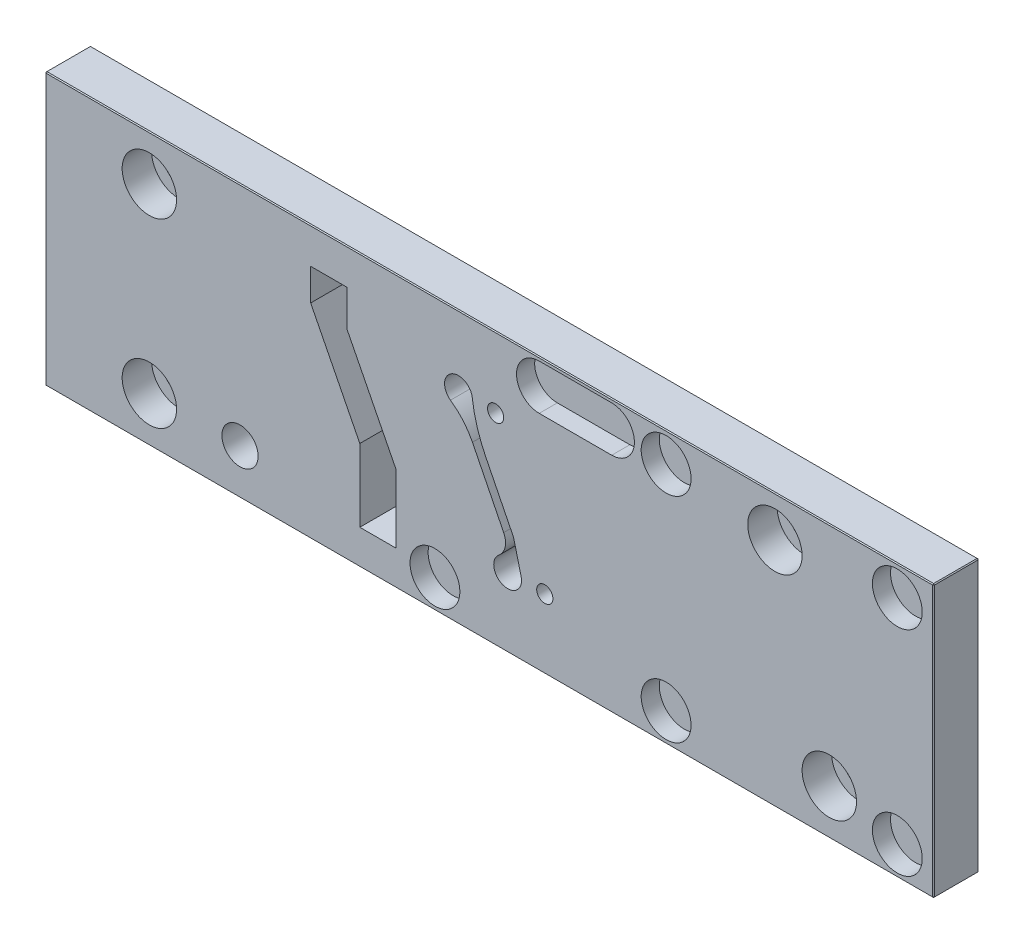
ISO-10303-21;
HEADER;
FILE_DESCRIPTION(('STEP AP214'),'2;1');
FILE_NAME('part.step','',(''),(''),'','','');
FILE_SCHEMA(('AUTOMOTIVE_DESIGN { 1 0 10303 214 1 1 1 1 }'));
ENDSEC;
DATA;
#1=APPLICATION_CONTEXT('core data for automotive mechanical design processes');
#2=APPLICATION_PROTOCOL_DEFINITION('international standard','automotive_design',2000,#1);
#3=PRODUCT_CONTEXT('',#1,'mechanical');
#4=PRODUCT('Part','Part','',(#3));
#5=PRODUCT_RELATED_PRODUCT_CATEGORY('part','',(#4));
#6=PRODUCT_DEFINITION_FORMATION('','',#4);
#7=PRODUCT_DEFINITION_CONTEXT('part definition',#1,'design');
#8=PRODUCT_DEFINITION('design','',#6,#7);
#9=PRODUCT_DEFINITION_SHAPE('','',#8);
#10=(LENGTH_UNIT() NAMED_UNIT(*) SI_UNIT(.MILLI.,.METRE.));
#11=(NAMED_UNIT(*) PLANE_ANGLE_UNIT() SI_UNIT($,.RADIAN.));
#12=(NAMED_UNIT(*) SI_UNIT($,.STERADIAN.) SOLID_ANGLE_UNIT());
#13=UNCERTAINTY_MEASURE_WITH_UNIT(LENGTH_MEASURE(1.E-05),#10,'distance_accuracy_value','');
#14=(GEOMETRIC_REPRESENTATION_CONTEXT(3) GLOBAL_UNCERTAINTY_ASSIGNED_CONTEXT((#13)) GLOBAL_UNIT_ASSIGNED_CONTEXT((#10,
#11,#12)) REPRESENTATION_CONTEXT('',''));
#15=CARTESIAN_POINT('',(0.,0.,0.));
#16=DIRECTION('',(0.,0.,1.));
#17=DIRECTION('',(1.,0.,0.));
#18=AXIS2_PLACEMENT_3D('',#15,#16,#17);
#19=CARTESIAN_POINT('',(195.9,0.099999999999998,9.8));
#20=DIRECTION('',(0.577350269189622,-0.577350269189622,0.577350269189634));
#21=DIRECTION('',(0.707106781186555,0.,-0.70710678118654));
#22=AXIS2_PLACEMENT_3D('',#19,#20,#21);
#23=PLANE('',#22);
#24=DIRECTION('',(0.,-0.707106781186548,-0.707106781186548));
#25=VECTOR('',#24,1.);
#26=CARTESIAN_POINT('',(195.8,0.1,9.9));
#27=LINE('',#26,#25);
#28=CARTESIAN_POINT('',(195.8,0.,9.80000000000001));
#29=VERTEX_POINT('',#28);
#30=CARTESIAN_POINT('',(195.8,0.199999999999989,10.));
#31=VERTEX_POINT('',#30);
#32=EDGE_CURVE('E428',#29,#31,#27,.F.);
#33=ORIENTED_EDGE('',*,*,#32,.F.);
#34=DIRECTION('',(0.707106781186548,0.707106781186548,0.));
#35=VECTOR('',#34,1.);
#36=CARTESIAN_POINT('',(195.9,0.099999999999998,9.8));
#37=LINE('',#36,#35);
#38=CARTESIAN_POINT('',(196.,0.199999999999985,9.80000000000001));
#39=VERTEX_POINT('',#38);
#40=EDGE_CURVE('E432',#39,#29,#37,.F.);
#41=ORIENTED_EDGE('',*,*,#40,.F.);
#42=DIRECTION('',(0.70710678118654,0.,-0.707106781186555));
#43=VECTOR('',#42,1.);
#44=CARTESIAN_POINT('',(195.9,0.199999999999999,9.9));
#45=LINE('',#44,#43);
#46=EDGE_CURVE('E426',#31,#39,#45,.T.);
#47=ORIENTED_EDGE('',*,*,#46,.F.);
#48=EDGE_LOOP('',(#33,#41,#47));
#49=FACE_BOUND('',#48,.T.);
#50=ADVANCED_FACE('F17',(#49),#23,.T.);
#51=CARTESIAN_POINT('',(195.9,59.9,9.8));
#52=DIRECTION('',(0.577350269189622,0.577350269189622,0.577350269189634));
#53=DIRECTION('',(0.707106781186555,0.,-0.70710678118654));
#54=AXIS2_PLACEMENT_3D('',#51,#52,#53);
#55=PLANE('',#54);
#56=DIRECTION('',(0.70710678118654,0.,-0.707106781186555));
#57=VECTOR('',#56,1.);
#58=CARTESIAN_POINT('',(195.9,59.8,9.9));
#59=LINE('',#58,#57);
#60=CARTESIAN_POINT('',(196.,59.8,9.80000000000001));
#61=VERTEX_POINT('',#60);
#62=CARTESIAN_POINT('',(195.8,59.8,10.));
#63=VERTEX_POINT('',#62);
#64=EDGE_CURVE('E424',#61,#63,#59,.F.);
#65=ORIENTED_EDGE('',*,*,#64,.F.);
#66=DIRECTION('',(-0.707106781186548,0.707106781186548,0.));
#67=VECTOR('',#66,1.);
#68=CARTESIAN_POINT('',(195.9,59.9,9.8));
#69=LINE('',#68,#67);
#70=CARTESIAN_POINT('',(195.8,60.,9.80000000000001));
#71=VERTEX_POINT('',#70);
#72=EDGE_CURVE('E261',#71,#61,#69,.F.);
#73=ORIENTED_EDGE('',*,*,#72,.F.);
#74=DIRECTION('',(0.,-0.70710678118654,0.707106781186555));
#75=VECTOR('',#74,1.);
#76=CARTESIAN_POINT('',(195.8,59.9,9.90000000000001));
#77=LINE('',#76,#75);
#78=EDGE_CURVE('E422',#63,#71,#77,.F.);
#79=ORIENTED_EDGE('',*,*,#78,.F.);
#80=EDGE_LOOP('',(#65,#73,#79));
#81=FACE_BOUND('',#80,.T.);
#82=ADVANCED_FACE('F465',(#81),#55,.T.);
#83=CARTESIAN_POINT('',(0.099999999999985,59.9,9.8));
#84=DIRECTION('',(-0.577350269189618,0.577350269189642,0.577350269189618));
#85=DIRECTION('',(0.,-0.707106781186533,0.707106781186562));
#86=AXIS2_PLACEMENT_3D('',#83,#84,#85);
#87=PLANE('',#86);
#88=DIRECTION('',(0.707106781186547,0.,0.707106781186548));
#89=VECTOR('',#88,1.);
#90=CARTESIAN_POINT('',(0.0999999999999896,59.8,9.90000000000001));
#91=LINE('',#90,#89);
#92=CARTESIAN_POINT('',(0.199999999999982,59.8,10.));
#93=VERTEX_POINT('',#92);
#94=CARTESIAN_POINT('',(0.,59.8,9.8));
#95=VERTEX_POINT('',#94);
#96=EDGE_CURVE('E418',#93,#95,#91,.F.);
#97=ORIENTED_EDGE('',*,*,#96,.F.);
#98=DIRECTION('',(0.,-0.70710678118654,0.707106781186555));
#99=VECTOR('',#98,1.);
#100=CARTESIAN_POINT('',(0.199999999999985,59.9,9.9));
#101=LINE('',#100,#99);
#102=CARTESIAN_POINT('',(0.199999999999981,60.,9.8));
#103=VERTEX_POINT('',#102);
#104=EDGE_CURVE('E420',#103,#93,#101,.T.);
#105=ORIENTED_EDGE('',*,*,#104,.F.);
#106=DIRECTION('',(-0.707106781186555,-0.70710678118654,0.));
#107=VECTOR('',#106,1.);
#108=CARTESIAN_POINT('',(0.099999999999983,59.9,9.8));
#109=LINE('',#108,#107);
#110=EDGE_CURVE('E440',#95,#103,#109,.F.);
#111=ORIENTED_EDGE('',*,*,#110,.F.);
#112=EDGE_LOOP('',(#97,#105,#111));
#113=FACE_BOUND('',#112,.T.);
#114=ADVANCED_FACE('F559',(#113),#87,.T.);
#115=CARTESIAN_POINT('',(0.099999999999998,0.1,9.8));
#116=DIRECTION('',(-0.577350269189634,-0.577350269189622,0.577350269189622));
#117=DIRECTION('',(0.70710678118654,0.,0.707106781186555));
#118=AXIS2_PLACEMENT_3D('',#115,#116,#117);
#119=PLANE('',#118);
#120=DIRECTION('',(0.,-0.707106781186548,-0.707106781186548));
#121=VECTOR('',#120,1.);
#122=CARTESIAN_POINT('',(0.19999999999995,0.1,9.9));
#123=LINE('',#122,#121);
#124=CARTESIAN_POINT('',(0.199999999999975,0.199999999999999,10.));
#125=VERTEX_POINT('',#124);
#126=CARTESIAN_POINT('',(0.199999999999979,0.,9.8));
#127=VERTEX_POINT('',#126);
#128=EDGE_CURVE('E430',#125,#127,#123,.T.);
#129=ORIENTED_EDGE('',*,*,#128,.F.);
#130=DIRECTION('',(0.707106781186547,0.,0.707106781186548));
#131=VECTOR('',#130,1.);
#132=CARTESIAN_POINT('',(0.0999999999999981,0.200000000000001,9.9));
#133=LINE('',#132,#131);
#134=CARTESIAN_POINT('',(0.,0.2,9.8));
#135=VERTEX_POINT('',#134);
#136=EDGE_CURVE('E245',#135,#125,#133,.T.);
#137=ORIENTED_EDGE('',*,*,#136,.F.);
#138=DIRECTION('',(0.70710678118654,-0.707106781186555,0.));
#139=VECTOR('',#138,1.);
#140=CARTESIAN_POINT('',(0.099999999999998,0.1,9.8));
#141=LINE('',#140,#139);
#142=EDGE_CURVE('E436',#127,#135,#141,.F.);
#143=ORIENTED_EDGE('',*,*,#142,.F.);
#144=EDGE_LOOP('',(#129,#137,#143));
#145=FACE_BOUND('',#144,.T.);
#146=ADVANCED_FACE('F580',(#145),#119,.T.);
#147=CARTESIAN_POINT('',(116.999999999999,54.2061087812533,6.));
#148=DIRECTION('',(0.,0.,1.));
#149=DIRECTION('',(1.,0.,0.));
#150=AXIS2_PLACEMENT_3D('',#147,#148,#149);
#151=PLANE('',#150);
#152=CARTESIAN_POINT('',(124.999999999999,54.2061087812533,6.));
#153=DIRECTION('',(0.,0.,-1.));
#154=DIRECTION('',(-1.,0.,0.));
#155=AXIS2_PLACEMENT_3D('',#152,#153,#154);
#156=CIRCLE('',#155,5.);
#157=CARTESIAN_POINT('',(124.999999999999,49.2061087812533,6.));
#158=VERTEX_POINT('',#157);
#159=CARTESIAN_POINT('',(124.999999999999,59.2061087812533,6.));
#160=VERTEX_POINT('',#159);
#161=EDGE_CURVE('E253',#158,#160,#156,.F.);
#162=ORIENTED_EDGE('',*,*,#161,.T.);
#163=DIRECTION('',(1.,0.,0.));
#164=VECTOR('',#163,1.);
#165=CARTESIAN_POINT('',(108.999999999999,59.2061087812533,6.));
#166=LINE('',#165,#164);
#167=CARTESIAN_POINT('',(108.999999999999,59.2061087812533,6.));
#168=VERTEX_POINT('',#167);
#169=EDGE_CURVE('E249',#160,#168,#166,.F.);
#170=ORIENTED_EDGE('',*,*,#169,.T.);
#171=CARTESIAN_POINT('',(108.999999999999,54.2061087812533,6.));
#172=DIRECTION('',(0.,0.,-1.));
#173=DIRECTION('',(-1.,0.,0.));
#174=AXIS2_PLACEMENT_3D('',#171,#172,#173);
#175=CIRCLE('',#174,5.);
#176=CARTESIAN_POINT('',(108.999999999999,49.2061087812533,6.));
#177=VERTEX_POINT('',#176);
#178=EDGE_CURVE('E20',#168,#177,#175,.F.);
#179=ORIENTED_EDGE('',*,*,#178,.T.);
#180=DIRECTION('',(1.,0.,0.));
#181=VECTOR('',#180,1.);
#182=CARTESIAN_POINT('',(124.999999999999,49.2061087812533,6.));
#183=LINE('',#182,#181);
#184=EDGE_CURVE('E236',#177,#158,#183,.T.);
#185=ORIENTED_EDGE('',*,*,#184,.T.);
#186=EDGE_LOOP('',(#162,#170,#179,#185));
#187=FACE_BOUND('',#186,.T.);
#188=ADVANCED_FACE('F252',(#187),#151,.T.);
#189=CARTESIAN_POINT('',(187.999999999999,53.4761087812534,6.));
#190=DIRECTION('',(0.,0.,1.));
#191=DIRECTION('',(1.,0.,0.));
#192=AXIS2_PLACEMENT_3D('',#189,#190,#191);
#193=PLANE('',#192);
#194=CARTESIAN_POINT('',(187.999999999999,53.4761087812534,6.));
#195=DIRECTION('',(0.,0.,1.));
#196=DIRECTION('',(1.,0.,0.));
#197=AXIS2_PLACEMENT_3D('',#194,#195,#196);
#198=CIRCLE('',#197,5.5);
#199=CARTESIAN_POINT('',(193.499999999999,53.4761087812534,6.));
#200=VERTEX_POINT('',#199);
#201=EDGE_CURVE('E410',#200,#200,#198,.T.);
#202=ORIENTED_EDGE('',*,*,#201,.T.);
#203=EDGE_LOOP('',(#202));
#204=FACE_BOUND('',#203,.T.);
#205=ADVANCED_FACE('F1194',(#204),#193,.T.);
#206=CARTESIAN_POINT('',(137.,6.37610878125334,6.));
#207=DIRECTION('',(0.,0.,1.));
#208=DIRECTION('',(1.,0.,0.));
#209=AXIS2_PLACEMENT_3D('',#206,#207,#208);
#210=PLANE('',#209);
#211=CARTESIAN_POINT('',(137.,6.37610878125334,6.));
#212=DIRECTION('',(0.,0.,1.));
#213=DIRECTION('',(1.,0.,0.));
#214=AXIS2_PLACEMENT_3D('',#211,#212,#213);
#215=CIRCLE('',#214,5.5);
#216=CARTESIAN_POINT('',(142.5,6.37610878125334,6.));
#217=VERTEX_POINT('',#216);
#218=EDGE_CURVE('E407',#217,#217,#215,.T.);
#219=ORIENTED_EDGE('',*,*,#218,.T.);
#220=EDGE_LOOP('',(#219));
#221=FACE_BOUND('',#220,.T.);
#222=ADVANCED_FACE('F1186',(#221),#210,.T.);
#223=CARTESIAN_POINT('',(85.9999999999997,6.37610878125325,6.));
#224=DIRECTION('',(0.,0.,1.));
#225=DIRECTION('',(1.,0.,0.));
#226=AXIS2_PLACEMENT_3D('',#223,#224,#225);
#227=PLANE('',#226);
#228=CARTESIAN_POINT('',(85.9999999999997,6.37610878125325,6.));
#229=DIRECTION('',(0.,0.,1.));
#230=DIRECTION('',(1.,0.,0.));
#231=AXIS2_PLACEMENT_3D('',#228,#229,#230);
#232=CIRCLE('',#231,5.5);
#233=CARTESIAN_POINT('',(91.4999999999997,6.37610878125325,6.));
#234=VERTEX_POINT('',#233);
#235=EDGE_CURVE('E404',#234,#234,#232,.T.);
#236=ORIENTED_EDGE('',*,*,#235,.T.);
#237=EDGE_LOOP('',(#236));
#238=FACE_BOUND('',#237,.T.);
#239=ADVANCED_FACE('F1178',(#238),#227,.T.);
#240=CARTESIAN_POINT('',(187.999999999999,6.37610878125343,6.));
#241=DIRECTION('',(0.,0.,1.));
#242=DIRECTION('',(1.,0.,0.));
#243=AXIS2_PLACEMENT_3D('',#240,#241,#242);
#244=PLANE('',#243);
#245=CARTESIAN_POINT('',(187.999999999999,6.37610878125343,6.));
#246=DIRECTION('',(0.,0.,1.));
#247=DIRECTION('',(1.,0.,0.));
#248=AXIS2_PLACEMENT_3D('',#245,#246,#247);
#249=CIRCLE('',#248,5.5);
#250=CARTESIAN_POINT('',(193.499999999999,6.37610878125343,6.));
#251=VERTEX_POINT('',#250);
#252=EDGE_CURVE('E401',#251,#251,#249,.T.);
#253=ORIENTED_EDGE('',*,*,#252,.T.);
#254=EDGE_LOOP('',(#253));
#255=FACE_BOUND('',#254,.T.);
#256=ADVANCED_FACE('F1170',(#255),#244,.T.);
#257=CARTESIAN_POINT('',(136.999999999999,53.4761087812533,6.));
#258=DIRECTION('',(0.,0.,1.));
#259=DIRECTION('',(1.,0.,0.));
#260=AXIS2_PLACEMENT_3D('',#257,#258,#259);
#261=PLANE('',#260);
#262=CARTESIAN_POINT('',(136.999999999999,53.4761087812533,6.));
#263=DIRECTION('',(0.,0.,1.));
#264=DIRECTION('',(1.,0.,0.));
#265=AXIS2_PLACEMENT_3D('',#262,#263,#264);
#266=CIRCLE('',#265,5.5);
#267=CARTESIAN_POINT('',(142.499999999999,53.4761087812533,6.));
#268=VERTEX_POINT('',#267);
#269=EDGE_CURVE('E397',#268,#268,#266,.T.);
#270=ORIENTED_EDGE('',*,*,#269,.T.);
#271=EDGE_LOOP('',(#270));
#272=FACE_BOUND('',#271,.T.);
#273=ADVANCED_FACE('F1163',(#272),#261,.T.);
#274=CARTESIAN_POINT('',(195.9,59.9,0.));
#275=DIRECTION('',(0.707106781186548,0.707106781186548,0.));
#276=DIRECTION('',(-0.707106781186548,0.707106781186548,0.));
#277=AXIS2_PLACEMENT_3D('',#274,#275,#276);
#278=PLANE('',#277);
#279=DIRECTION('',(-0.707106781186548,0.707106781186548,0.));
#280=VECTOR('',#279,1.);
#281=CARTESIAN_POINT('',(195.9,59.9,0.2));
#282=LINE('',#281,#280);
#283=CARTESIAN_POINT('',(196.,59.8,0.199999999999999));
#284=VERTEX_POINT('',#283);
#285=CARTESIAN_POINT('',(195.8,60.,0.199999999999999));
#286=VERTEX_POINT('',#285);
#287=EDGE_CURVE('E441',#284,#286,#282,.T.);
#288=ORIENTED_EDGE('',*,*,#287,.T.);
#289=DIRECTION('',(0.,0.,1.));
#290=VECTOR('',#289,1.);
#291=CARTESIAN_POINT('',(195.8,60.,0.));
#292=LINE('',#291,#290);
#293=EDGE_CURVE('E451',#71,#286,#292,.F.);
#294=ORIENTED_EDGE('',*,*,#293,.F.);
#295=ORIENTED_EDGE('',*,*,#72,.T.);
#296=DIRECTION('',(0.,0.,-1.));
#297=VECTOR('',#296,1.);
#298=CARTESIAN_POINT('',(196.,59.8,0.));
#299=LINE('',#298,#297);
#300=EDGE_CURVE('E449',#284,#61,#299,.F.);
#301=ORIENTED_EDGE('',*,*,#300,.F.);
#302=EDGE_LOOP('',(#288,#294,#295,#301));
#303=FACE_BOUND('',#302,.T.);
#304=ADVANCED_FACE('F448',(#303),#278,.T.);
#305=CARTESIAN_POINT('',(0.099999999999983,59.9,0.));
#306=DIRECTION('',(-0.70710678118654,0.707106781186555,0.));
#307=DIRECTION('',(-0.707106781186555,-0.70710678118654,0.));
#308=AXIS2_PLACEMENT_3D('',#305,#306,#307);
#309=PLANE('',#308);
#310=DIRECTION('',(-0.707106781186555,-0.70710678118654,0.));
#311=VECTOR('',#310,1.);
#312=CARTESIAN_POINT('',(0.099999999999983,59.9,0.2));
#313=LINE('',#312,#311);
#314=CARTESIAN_POINT('',(0.199999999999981,60.,0.199999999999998));
#315=VERTEX_POINT('',#314);
#316=CARTESIAN_POINT('',(0.,59.8,0.199999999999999));
#317=VERTEX_POINT('',#316);
#318=EDGE_CURVE('E438',#315,#317,#313,.T.);
#319=ORIENTED_EDGE('',*,*,#318,.T.);
#320=DIRECTION('',(0.,0.,1.));
#321=VECTOR('',#320,1.);
#322=CARTESIAN_POINT('',(0.,59.8,0.));
#323=LINE('',#322,#321);
#324=EDGE_CURVE('E497',#95,#317,#323,.F.);
#325=ORIENTED_EDGE('',*,*,#324,.F.);
#326=ORIENTED_EDGE('',*,*,#110,.T.);
#327=DIRECTION('',(0.,0.,1.));
#328=VECTOR('',#327,1.);
#329=CARTESIAN_POINT('',(0.199999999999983,60.,0.));
#330=LINE('',#329,#328);
#331=EDGE_CURVE('E474',#315,#103,#330,.T.);
#332=ORIENTED_EDGE('',*,*,#331,.F.);
#333=EDGE_LOOP('',(#319,#325,#326,#332));
#334=FACE_BOUND('',#333,.T.);
#335=ADVANCED_FACE('F699',(#334),#309,.T.);
#336=CARTESIAN_POINT('',(0.099999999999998,0.1,0.));
#337=DIRECTION('',(-0.707106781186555,-0.70710678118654,0.));
#338=DIRECTION('',(0.70710678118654,-0.707106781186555,0.));
#339=AXIS2_PLACEMENT_3D('',#336,#337,#338);
#340=PLANE('',#339);
#341=DIRECTION('',(0.70710678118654,-0.707106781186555,0.));
#342=VECTOR('',#341,1.);
#343=CARTESIAN_POINT('',(0.099999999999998,0.1,0.2));
#344=LINE('',#343,#342);
#345=CARTESIAN_POINT('',(0.,0.199999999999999,0.2));
#346=VERTEX_POINT('',#345);
#347=CARTESIAN_POINT('',(0.2,0.,0.2));
#348=VERTEX_POINT('',#347);
#349=EDGE_CURVE('E434',#346,#348,#344,.T.);
#350=ORIENTED_EDGE('',*,*,#349,.T.);
#351=DIRECTION('',(0.,0.,-1.));
#352=VECTOR('',#351,1.);
#353=CARTESIAN_POINT('',(0.200000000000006,0.,0.));
#354=LINE('',#353,#352);
#355=EDGE_CURVE('E533',#127,#348,#354,.T.);
#356=ORIENTED_EDGE('',*,*,#355,.F.);
#357=ORIENTED_EDGE('',*,*,#142,.T.);
#358=DIRECTION('',(0.,0.,1.));
#359=VECTOR('',#358,1.);
#360=CARTESIAN_POINT('',(0.,0.2,0.));
#361=LINE('',#360,#359);
#362=EDGE_CURVE('E543',#346,#135,#361,.T.);
#363=ORIENTED_EDGE('',*,*,#362,.F.);
#364=EDGE_LOOP('',(#350,#356,#357,#363));
#365=FACE_BOUND('',#364,.T.);
#366=ADVANCED_FACE('F585',(#365),#340,.T.);
#367=CARTESIAN_POINT('',(195.9,0.099999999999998,0.));
#368=DIRECTION('',(0.707106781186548,-0.707106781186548,0.));
#369=DIRECTION('',(0.707106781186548,0.707106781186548,0.));
#370=AXIS2_PLACEMENT_3D('',#367,#368,#369);
#371=PLANE('',#370);
#372=DIRECTION('',(-0.707106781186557,-0.707106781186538,0.));
#373=VECTOR('',#372,1.);
#374=CARTESIAN_POINT('',(196.,0.2,0.200000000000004));
#375=LINE('',#374,#373);
#376=CARTESIAN_POINT('',(196.,0.199999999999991,0.199999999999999));
#377=VERTEX_POINT('',#376);
#378=CARTESIAN_POINT('',(195.8,0.,0.2));
#379=VERTEX_POINT('',#378);
#380=EDGE_CURVE('E489',#377,#379,#375,.T.);
#381=ORIENTED_EDGE('',*,*,#380,.F.);
#382=DIRECTION('',(0.,0.,-1.));
#383=VECTOR('',#382,1.);
#384=CARTESIAN_POINT('',(196.,0.199999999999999,0.));
#385=LINE('',#384,#383);
#386=EDGE_CURVE('E400',#39,#377,#385,.T.);
#387=ORIENTED_EDGE('',*,*,#386,.F.);
#388=ORIENTED_EDGE('',*,*,#40,.T.);
#389=DIRECTION('',(0.,0.,-1.));
#390=VECTOR('',#389,1.);
#391=CARTESIAN_POINT('',(195.8,0.,0.));
#392=LINE('',#391,#390);
#393=EDGE_CURVE('E396',#379,#29,#392,.F.);
#394=ORIENTED_EDGE('',*,*,#393,.F.);
#395=EDGE_LOOP('',(#381,#387,#388,#394));
#396=FACE_BOUND('',#395,.T.);
#397=ADVANCED_FACE('F490',(#396),#371,.T.);
#398=CARTESIAN_POINT('',(147.,0.1,9.9));
#399=DIRECTION('',(0.,-0.707106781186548,0.707106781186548));
#400=DIRECTION('',(0.,-0.707106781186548,-0.707106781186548));
#401=AXIS2_PLACEMENT_3D('',#398,#399,#400);
#402=PLANE('',#401);
#403=ORIENTED_EDGE('',*,*,#32,.T.);
#404=DIRECTION('',(1.,0.,0.));
#405=VECTOR('',#404,1.);
#406=CARTESIAN_POINT('',(98.,0.199999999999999,10.));
#407=LINE('',#406,#405);
#408=EDGE_CURVE('E395',#125,#31,#407,.T.);
#409=ORIENTED_EDGE('',*,*,#408,.F.);
#410=ORIENTED_EDGE('',*,*,#128,.T.);
#411=DIRECTION('',(1.,0.,0.));
#412=VECTOR('',#411,1.);
#413=CARTESIAN_POINT('',(196.,0.,9.8));
#414=LINE('',#413,#412);
#415=EDGE_CURVE('E496',#29,#127,#414,.F.);
#416=ORIENTED_EDGE('',*,*,#415,.F.);
#417=EDGE_LOOP('',(#403,#409,#410,#416));
#418=FACE_BOUND('',#417,.T.);
#419=ADVANCED_FACE('F576',(#418),#402,.T.);
#420=CARTESIAN_POINT('',(195.9,45.,9.9));
#421=DIRECTION('',(0.707106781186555,0.,0.70710678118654));
#422=DIRECTION('',(0.70710678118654,0.,-0.707106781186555));
#423=AXIS2_PLACEMENT_3D('',#420,#421,#422);
#424=PLANE('',#423);
#425=ORIENTED_EDGE('',*,*,#64,.T.);
#426=DIRECTION('',(0.,1.,0.));
#427=VECTOR('',#426,1.);
#428=CARTESIAN_POINT('',(195.8,30.,10.));
#429=LINE('',#428,#427);
#430=EDGE_CURVE('E517',#31,#63,#429,.T.);
#431=ORIENTED_EDGE('',*,*,#430,.F.);
#432=ORIENTED_EDGE('',*,*,#46,.T.);
#433=DIRECTION('',(0.,1.,0.));
#434=VECTOR('',#433,1.);
#435=CARTESIAN_POINT('',(196.,60.,9.8));
#436=LINE('',#435,#434);
#437=EDGE_CURVE('E460',#61,#39,#436,.F.);
#438=ORIENTED_EDGE('',*,*,#437,.F.);
#439=EDGE_LOOP('',(#425,#431,#432,#438));
#440=FACE_BOUND('',#439,.T.);
#441=ADVANCED_FACE('F470',(#440),#424,.T.);
#442=CARTESIAN_POINT('',(49.,59.9,9.9));
#443=DIRECTION('',(0.,0.707106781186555,0.70710678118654));
#444=DIRECTION('',(0.,-0.70710678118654,0.707106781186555));
#445=AXIS2_PLACEMENT_3D('',#442,#443,#444);
#446=PLANE('',#445);
#447=ORIENTED_EDGE('',*,*,#104,.T.);
#448=DIRECTION('',(1.,0.,0.));
#449=VECTOR('',#448,1.);
#450=CARTESIAN_POINT('',(98.,59.8,10.));
#451=LINE('',#450,#449);
#452=EDGE_CURVE('E514',#63,#93,#451,.F.);
#453=ORIENTED_EDGE('',*,*,#452,.F.);
#454=ORIENTED_EDGE('',*,*,#78,.T.);
#455=DIRECTION('',(1.,0.,0.));
#456=VECTOR('',#455,1.);
#457=CARTESIAN_POINT('',(0.,60.,9.8));
#458=LINE('',#457,#456);
#459=EDGE_CURVE('E546',#103,#71,#458,.T.);
#460=ORIENTED_EDGE('',*,*,#459,.F.);
#461=EDGE_LOOP('',(#447,#453,#454,#460));
#462=FACE_BOUND('',#461,.T.);
#463=ADVANCED_FACE('F563',(#462),#446,.T.);
#464=CARTESIAN_POINT('',(0.099999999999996,15.,9.9));
#465=DIRECTION('',(-0.707106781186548,0.,0.707106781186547));
#466=DIRECTION('',(0.707106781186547,0.,0.707106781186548));
#467=AXIS2_PLACEMENT_3D('',#464,#465,#466);
#468=PLANE('',#467);
#469=ORIENTED_EDGE('',*,*,#136,.T.);
#470=DIRECTION('',(0.,1.,0.));
#471=VECTOR('',#470,1.);
#472=CARTESIAN_POINT('',(0.199999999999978,30.,10.));
#473=LINE('',#472,#471);
#474=EDGE_CURVE('E392',#93,#125,#473,.F.);
#475=ORIENTED_EDGE('',*,*,#474,.F.);
#476=ORIENTED_EDGE('',*,*,#96,.T.);
#477=DIRECTION('',(0.,1.,0.));
#478=VECTOR('',#477,1.);
#479=CARTESIAN_POINT('',(0.,0.,9.8));
#480=LINE('',#479,#478);
#481=EDGE_CURVE('E540',#135,#95,#480,.T.);
#482=ORIENTED_EDGE('',*,*,#481,.F.);
#483=EDGE_LOOP('',(#469,#475,#476,#482));
#484=FACE_BOUND('',#483,.T.);
#485=ADVANCED_FACE('F703',(#484),#468,.T.);
#486=CARTESIAN_POINT('',(124.999999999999,49.2061087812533,10.));
#487=DIRECTION('',(0.,-1.,0.));
#488=DIRECTION('',(0.,0.,-1.));
#489=AXIS2_PLACEMENT_3D('',#486,#487,#488);
#490=PLANE('',#489);
#491=DIRECTION('',(0.,0.,-1.));
#492=VECTOR('',#491,1.);
#493=CARTESIAN_POINT('',(124.999999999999,49.2061087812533,10.));
#494=LINE('',#493,#492);
#495=CARTESIAN_POINT('',(124.999999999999,49.2061087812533,10.));
#496=VERTEX_POINT('',#495);
#497=EDGE_CURVE('E241',#496,#158,#494,.T.);
#498=ORIENTED_EDGE('',*,*,#497,.T.);
#499=ORIENTED_EDGE('',*,*,#184,.F.);
#500=DIRECTION('',(0.,0.,-1.));
#501=VECTOR('',#500,1.);
#502=CARTESIAN_POINT('',(108.999999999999,49.2061087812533,10.));
#503=LINE('',#502,#501);
#504=CARTESIAN_POINT('',(108.999999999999,49.2061087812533,10.));
#505=VERTEX_POINT('',#504);
#506=EDGE_CURVE('E239',#177,#505,#503,.F.);
#507=ORIENTED_EDGE('',*,*,#506,.T.);
#508=DIRECTION('',(1.,0.,0.));
#509=VECTOR('',#508,1.);
#510=CARTESIAN_POINT('',(98.,49.2061087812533,10.));
#511=LINE('',#510,#509);
#512=EDGE_CURVE('E389',#496,#505,#511,.F.);
#513=ORIENTED_EDGE('',*,*,#512,.F.);
#514=EDGE_LOOP('',(#498,#499,#507,#513));
#515=FACE_BOUND('',#514,.T.);
#516=ADVANCED_FACE('F237',(#515),#490,.F.);
#517=CARTESIAN_POINT('',(108.999999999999,54.2061087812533,10.));
#518=DIRECTION('',(0.,0.,-1.));
#519=DIRECTION('',(-1.,0.,0.));
#520=AXIS2_PLACEMENT_3D('',#517,#518,#519);
#521=CYLINDRICAL_SURFACE('',#520,5.);
#522=ORIENTED_EDGE('',*,*,#506,.F.);
#523=ORIENTED_EDGE('',*,*,#178,.F.);
#524=DIRECTION('',(0.,0.,1.));
#525=VECTOR('',#524,1.);
#526=CARTESIAN_POINT('',(108.999999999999,59.2061087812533,10.));
#527=LINE('',#526,#525);
#528=CARTESIAN_POINT('',(108.999999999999,59.2061087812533,10.));
#529=VERTEX_POINT('',#528);
#530=EDGE_CURVE('E257',#168,#529,#527,.T.);
#531=ORIENTED_EDGE('',*,*,#530,.T.);
#532=CARTESIAN_POINT('',(108.999999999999,54.2061087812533,10.));
#533=DIRECTION('',(0.,0.,-1.));
#534=DIRECTION('',(-1.,0.,0.));
#535=AXIS2_PLACEMENT_3D('',#532,#533,#534);
#536=CIRCLE('',#535,5.);
#537=EDGE_CURVE('E248',#505,#529,#536,.T.);
#538=ORIENTED_EDGE('',*,*,#537,.F.);
#539=EDGE_LOOP('',(#522,#523,#531,#538));
#540=FACE_BOUND('',#539,.T.);
#541=ADVANCED_FACE('F247',(#540),#521,.F.);
#542=CARTESIAN_POINT('',(108.999999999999,59.2061087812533,10.));
#543=DIRECTION('',(0.,1.,0.));
#544=DIRECTION('',(0.,0.,1.));
#545=AXIS2_PLACEMENT_3D('',#542,#543,#544);
#546=PLANE('',#545);
#547=ORIENTED_EDGE('',*,*,#530,.F.);
#548=ORIENTED_EDGE('',*,*,#169,.F.);
#549=DIRECTION('',(0.,0.,-1.));
#550=VECTOR('',#549,1.);
#551=CARTESIAN_POINT('',(124.999999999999,59.2061087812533,10.));
#552=LINE('',#551,#550);
#553=CARTESIAN_POINT('',(124.999999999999,59.2061087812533,10.));
#554=VERTEX_POINT('',#553);
#555=EDGE_CURVE('E412',#160,#554,#552,.F.);
#556=ORIENTED_EDGE('',*,*,#555,.T.);
#557=DIRECTION('',(1.,0.,0.));
#558=VECTOR('',#557,1.);
#559=CARTESIAN_POINT('',(98.,59.2061087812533,10.));
#560=LINE('',#559,#558);
#561=EDGE_CURVE('E387',#529,#554,#560,.T.);
#562=ORIENTED_EDGE('',*,*,#561,.F.);
#563=EDGE_LOOP('',(#547,#548,#556,#562));
#564=FACE_BOUND('',#563,.T.);
#565=ADVANCED_FACE('F894',(#564),#546,.F.);
#566=CARTESIAN_POINT('',(124.999999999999,54.2061087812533,10.));
#567=DIRECTION('',(0.,0.,-1.));
#568=DIRECTION('',(-1.,0.,0.));
#569=AXIS2_PLACEMENT_3D('',#566,#567,#568);
#570=CYLINDRICAL_SURFACE('',#569,5.);
#571=ORIENTED_EDGE('',*,*,#555,.F.);
#572=ORIENTED_EDGE('',*,*,#161,.F.);
#573=ORIENTED_EDGE('',*,*,#497,.F.);
#574=CARTESIAN_POINT('',(124.999999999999,54.2061087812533,10.));
#575=DIRECTION('',(0.,0.,-1.));
#576=DIRECTION('',(-1.,0.,0.));
#577=AXIS2_PLACEMENT_3D('',#574,#575,#576);
#578=CIRCLE('',#577,5.);
#579=EDGE_CURVE('E384',#554,#496,#578,.T.);
#580=ORIENTED_EDGE('',*,*,#579,.F.);
#581=EDGE_LOOP('',(#571,#572,#573,#580));
#582=FACE_BOUND('',#581,.T.);
#583=ADVANCED_FACE('F890',(#582),#570,.F.);
#584=CARTESIAN_POINT('',(187.999999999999,53.4761087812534,8.));
#585=DIRECTION('',(0.,0.,1.));
#586=DIRECTION('',(1.,0.,0.));
#587=AXIS2_PLACEMENT_3D('',#584,#585,#586);
#588=CYLINDRICAL_SURFACE('',#587,5.5);
#589=ORIENTED_EDGE('',*,*,#201,.F.);
#590=EDGE_LOOP('',(#589));
#591=FACE_BOUND('',#590,.T.);
#592=CARTESIAN_POINT('',(187.999999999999,53.4761087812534,10.));
#593=DIRECTION('',(0.,0.,1.));
#594=DIRECTION('',(1.,0.,0.));
#595=AXIS2_PLACEMENT_3D('',#592,#593,#594);
#596=CIRCLE('',#595,5.5);
#597=CARTESIAN_POINT('',(193.499999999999,53.4761087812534,10.));
#598=VERTEX_POINT('',#597);
#599=EDGE_CURVE('E381',#598,#598,#596,.F.);
#600=ORIENTED_EDGE('',*,*,#599,.F.);
#601=EDGE_LOOP('',(#600));
#602=FACE_BOUND('',#601,.T.);
#603=ADVANCED_FACE('F886',(#591,#602),#588,.F.);
#604=CARTESIAN_POINT('',(137.,6.37610878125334,8.));
#605=DIRECTION('',(0.,0.,1.));
#606=DIRECTION('',(1.,0.,0.));
#607=AXIS2_PLACEMENT_3D('',#604,#605,#606);
#608=CYLINDRICAL_SURFACE('',#607,5.5);
#609=ORIENTED_EDGE('',*,*,#218,.F.);
#610=EDGE_LOOP('',(#609));
#611=FACE_BOUND('',#610,.T.);
#612=CARTESIAN_POINT('',(137.,6.37610878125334,10.));
#613=DIRECTION('',(0.,0.,1.));
#614=DIRECTION('',(1.,0.,0.));
#615=AXIS2_PLACEMENT_3D('',#612,#613,#614);
#616=CIRCLE('',#615,5.5);
#617=CARTESIAN_POINT('',(142.5,6.37610878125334,10.));
#618=VERTEX_POINT('',#617);
#619=EDGE_CURVE('E378',#618,#618,#616,.F.);
#620=ORIENTED_EDGE('',*,*,#619,.F.);
#621=EDGE_LOOP('',(#620));
#622=FACE_BOUND('',#621,.T.);
#623=ADVANCED_FACE('F882',(#611,#622),#608,.F.);
#624=CARTESIAN_POINT('',(85.9999999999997,6.37610878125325,8.));
#625=DIRECTION('',(0.,0.,1.));
#626=DIRECTION('',(1.,0.,0.));
#627=AXIS2_PLACEMENT_3D('',#624,#625,#626);
#628=CYLINDRICAL_SURFACE('',#627,5.5);
#629=ORIENTED_EDGE('',*,*,#235,.F.);
#630=EDGE_LOOP('',(#629));
#631=FACE_BOUND('',#630,.T.);
#632=CARTESIAN_POINT('',(85.9999999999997,6.37610878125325,10.));
#633=DIRECTION('',(0.,0.,1.));
#634=DIRECTION('',(1.,0.,0.));
#635=AXIS2_PLACEMENT_3D('',#632,#633,#634);
#636=CIRCLE('',#635,5.5);
#637=CARTESIAN_POINT('',(91.4999999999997,6.37610878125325,10.));
#638=VERTEX_POINT('',#637);
#639=EDGE_CURVE('E375',#638,#638,#636,.F.);
#640=ORIENTED_EDGE('',*,*,#639,.F.);
#641=EDGE_LOOP('',(#640));
#642=FACE_BOUND('',#641,.T.);
#643=ADVANCED_FACE('F878',(#631,#642),#628,.F.);
#644=CARTESIAN_POINT('',(187.999999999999,6.37610878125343,8.));
#645=DIRECTION('',(0.,0.,1.));
#646=DIRECTION('',(1.,0.,0.));
#647=AXIS2_PLACEMENT_3D('',#644,#645,#646);
#648=CYLINDRICAL_SURFACE('',#647,5.5);
#649=ORIENTED_EDGE('',*,*,#252,.F.);
#650=EDGE_LOOP('',(#649));
#651=FACE_BOUND('',#650,.T.);
#652=CARTESIAN_POINT('',(187.999999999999,6.37610878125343,10.));
#653=DIRECTION('',(0.,0.,1.));
#654=DIRECTION('',(1.,0.,0.));
#655=AXIS2_PLACEMENT_3D('',#652,#653,#654);
#656=CIRCLE('',#655,5.5);
#657=CARTESIAN_POINT('',(193.499999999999,6.37610878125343,10.));
#658=VERTEX_POINT('',#657);
#659=EDGE_CURVE('E372',#658,#658,#656,.F.);
#660=ORIENTED_EDGE('',*,*,#659,.F.);
#661=EDGE_LOOP('',(#660));
#662=FACE_BOUND('',#661,.T.);
#663=ADVANCED_FACE('F874',(#651,#662),#648,.F.);
#664=CARTESIAN_POINT('',(136.999999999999,53.4761087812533,8.));
#665=DIRECTION('',(0.,0.,1.));
#666=DIRECTION('',(1.,0.,0.));
#667=AXIS2_PLACEMENT_3D('',#664,#665,#666);
#668=CYLINDRICAL_SURFACE('',#667,5.5);
#669=ORIENTED_EDGE('',*,*,#269,.F.);
#670=EDGE_LOOP('',(#669));
#671=FACE_BOUND('',#670,.T.);
#672=CARTESIAN_POINT('',(136.999999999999,53.4761087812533,10.));
#673=DIRECTION('',(0.,0.,1.));
#674=DIRECTION('',(1.,0.,0.));
#675=AXIS2_PLACEMENT_3D('',#672,#673,#674);
#676=CIRCLE('',#675,5.5);
#677=CARTESIAN_POINT('',(142.499999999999,53.4761087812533,10.));
#678=VERTEX_POINT('',#677);
#679=EDGE_CURVE('E369',#678,#678,#676,.F.);
#680=ORIENTED_EDGE('',*,*,#679,.F.);
#681=EDGE_LOOP('',(#680));
#682=FACE_BOUND('',#681,.T.);
#683=ADVANCED_FACE('F870',(#671,#682),#668,.F.);
#684=CARTESIAN_POINT('',(173.,10.0000000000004,6.75));
#685=DIRECTION('',(0.,0.,1.));
#686=DIRECTION('',(1.,0.,0.));
#687=AXIS2_PLACEMENT_3D('',#684,#685,#686);
#688=CYLINDRICAL_SURFACE('',#687,6.);
#689=CARTESIAN_POINT('',(173.,10.0000000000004,3.5));
#690=DIRECTION('',(0.,0.,1.));
#691=DIRECTION('',(1.,0.,0.));
#692=AXIS2_PLACEMENT_3D('',#689,#690,#691);
#693=CIRCLE('',#692,6.);
#694=CARTESIAN_POINT('',(179.,10.0000000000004,3.5));
#695=VERTEX_POINT('',#694);
#696=EDGE_CURVE('E354',#695,#695,#693,.T.);
#697=ORIENTED_EDGE('',*,*,#696,.F.);
#698=EDGE_LOOP('',(#697));
#699=FACE_BOUND('',#698,.T.);
#700=CARTESIAN_POINT('',(173.,10.0000000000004,10.));
#701=DIRECTION('',(0.,0.,1.));
#702=DIRECTION('',(1.,0.,0.));
#703=AXIS2_PLACEMENT_3D('',#700,#701,#702);
#704=CIRCLE('',#703,6.);
#705=CARTESIAN_POINT('',(179.,10.0000000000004,10.));
#706=VERTEX_POINT('',#705);
#707=EDGE_CURVE('E366',#706,#706,#704,.F.);
#708=ORIENTED_EDGE('',*,*,#707,.F.);
#709=EDGE_LOOP('',(#708));
#710=FACE_BOUND('',#709,.T.);
#711=ADVANCED_FACE('F866',(#699,#710),#688,.F.);
#712=CARTESIAN_POINT('',(23.0000000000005,50.0000000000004,6.75));
#713=DIRECTION('',(0.,0.,1.));
#714=DIRECTION('',(1.,0.,0.));
#715=AXIS2_PLACEMENT_3D('',#712,#713,#714);
#716=CYLINDRICAL_SURFACE('',#715,6.);
#717=CARTESIAN_POINT('',(23.0000000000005,50.0000000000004,3.5));
#718=DIRECTION('',(0.,0.,1.));
#719=DIRECTION('',(1.,0.,0.));
#720=AXIS2_PLACEMENT_3D('',#717,#718,#719);
#721=CIRCLE('',#720,6.);
#722=CARTESIAN_POINT('',(29.0000000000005,50.0000000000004,3.5));
#723=VERTEX_POINT('',#722);
#724=EDGE_CURVE('E351',#723,#723,#721,.T.);
#725=ORIENTED_EDGE('',*,*,#724,.F.);
#726=EDGE_LOOP('',(#725));
#727=FACE_BOUND('',#726,.T.);
#728=CARTESIAN_POINT('',(23.0000000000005,50.0000000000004,10.));
#729=DIRECTION('',(0.,0.,1.));
#730=DIRECTION('',(1.,0.,0.));
#731=AXIS2_PLACEMENT_3D('',#728,#729,#730);
#732=CIRCLE('',#731,6.);
#733=CARTESIAN_POINT('',(29.0000000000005,50.0000000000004,10.));
#734=VERTEX_POINT('',#733);
#735=EDGE_CURVE('E363',#734,#734,#732,.F.);
#736=ORIENTED_EDGE('',*,*,#735,.F.);
#737=EDGE_LOOP('',(#736));
#738=FACE_BOUND('',#737,.T.);
#739=ADVANCED_FACE('F862',(#727,#738),#716,.F.);
#740=CARTESIAN_POINT('',(23.0000000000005,10.0000000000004,6.75));
#741=DIRECTION('',(0.,0.,1.));
#742=DIRECTION('',(1.,0.,0.));
#743=AXIS2_PLACEMENT_3D('',#740,#741,#742);
#744=CYLINDRICAL_SURFACE('',#743,6.);
#745=CARTESIAN_POINT('',(23.0000000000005,10.0000000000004,3.5));
#746=DIRECTION('',(0.,0.,1.));
#747=DIRECTION('',(1.,0.,0.));
#748=AXIS2_PLACEMENT_3D('',#745,#746,#747);
#749=CIRCLE('',#748,6.);
#750=CARTESIAN_POINT('',(29.0000000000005,10.0000000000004,3.5));
#751=VERTEX_POINT('',#750);
#752=EDGE_CURVE('E348',#751,#751,#749,.T.);
#753=ORIENTED_EDGE('',*,*,#752,.F.);
#754=EDGE_LOOP('',(#753));
#755=FACE_BOUND('',#754,.T.);
#756=CARTESIAN_POINT('',(23.0000000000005,10.0000000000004,10.));
#757=DIRECTION('',(0.,0.,1.));
#758=DIRECTION('',(1.,0.,0.));
#759=AXIS2_PLACEMENT_3D('',#756,#757,#758);
#760=CIRCLE('',#759,6.);
#761=CARTESIAN_POINT('',(29.0000000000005,10.0000000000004,10.));
#762=VERTEX_POINT('',#761);
#763=EDGE_CURVE('E360',#762,#762,#760,.F.);
#764=ORIENTED_EDGE('',*,*,#763,.F.);
#765=EDGE_LOOP('',(#764));
#766=FACE_BOUND('',#765,.T.);
#767=ADVANCED_FACE('F858',(#755,#766),#744,.F.);
#768=CARTESIAN_POINT('',(161.,51.0000000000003,6.75));
#769=DIRECTION('',(0.,0.,1.));
#770=DIRECTION('',(1.,0.,0.));
#771=AXIS2_PLACEMENT_3D('',#768,#769,#770);
#772=CYLINDRICAL_SURFACE('',#771,6.);
#773=CARTESIAN_POINT('',(161.,51.0000000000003,3.5));
#774=DIRECTION('',(0.,0.,1.));
#775=DIRECTION('',(1.,0.,0.));
#776=AXIS2_PLACEMENT_3D('',#773,#774,#775);
#777=CIRCLE('',#776,6.);
#778=CARTESIAN_POINT('',(167.,51.0000000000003,3.5));
#779=VERTEX_POINT('',#778);
#780=EDGE_CURVE('E344',#779,#779,#777,.T.);
#781=ORIENTED_EDGE('',*,*,#780,.F.);
#782=EDGE_LOOP('',(#781));
#783=FACE_BOUND('',#782,.T.);
#784=CARTESIAN_POINT('',(161.,51.0000000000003,10.));
#785=DIRECTION('',(0.,0.,1.));
#786=DIRECTION('',(1.,0.,0.));
#787=AXIS2_PLACEMENT_3D('',#784,#785,#786);
#788=CIRCLE('',#787,6.);
#789=CARTESIAN_POINT('',(167.,51.0000000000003,10.));
#790=VERTEX_POINT('',#789);
#791=EDGE_CURVE('E357',#790,#790,#788,.F.);
#792=ORIENTED_EDGE('',*,*,#791,.F.);
#793=EDGE_LOOP('',(#792));
#794=FACE_BOUND('',#793,.T.);
#795=ADVANCED_FACE('F855',(#783,#794),#772,.F.);
#796=CARTESIAN_POINT('',(196.,60.,0.));
#797=DIRECTION('',(1.,0.,0.));
#798=DIRECTION('',(0.,0.,-1.));
#799=AXIS2_PLACEMENT_3D('',#796,#797,#798);
#800=PLANE('',#799);
#801=ORIENTED_EDGE('',*,*,#300,.T.);
#802=ORIENTED_EDGE('',*,*,#437,.T.);
#803=ORIENTED_EDGE('',*,*,#386,.T.);
#804=DIRECTION('',(0.,1.,0.));
#805=VECTOR('',#804,1.);
#806=CARTESIAN_POINT('',(196.,45.,0.199999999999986));
#807=LINE('',#806,#805);
#808=EDGE_CURVE('E463',#284,#377,#807,.F.);
#809=ORIENTED_EDGE('',*,*,#808,.F.);
#810=EDGE_LOOP('',(#801,#802,#803,#809));
#811=FACE_BOUND('',#810,.T.);
#812=ADVANCED_FACE('F458',(#811),#800,.T.);
#813=CARTESIAN_POINT('',(0.,60.,0.));
#814=DIRECTION('',(0.,1.,0.));
#815=DIRECTION('',(0.,0.,1.));
#816=AXIS2_PLACEMENT_3D('',#813,#814,#815);
#817=PLANE('',#816);
#818=ORIENTED_EDGE('',*,*,#331,.T.);
#819=ORIENTED_EDGE('',*,*,#459,.T.);
#820=ORIENTED_EDGE('',*,*,#293,.T.);
#821=DIRECTION('',(1.,0.,0.));
#822=VECTOR('',#821,1.);
#823=CARTESIAN_POINT('',(49.,60.,0.199999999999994));
#824=LINE('',#823,#822);
#825=EDGE_CURVE('E505',#315,#286,#824,.T.);
#826=ORIENTED_EDGE('',*,*,#825,.F.);
#827=EDGE_LOOP('',(#818,#819,#820,#826));
#828=FACE_BOUND('',#827,.T.);
#829=ADVANCED_FACE('F552',(#828),#817,.T.);
#830=CARTESIAN_POINT('',(195.8,59.8,0.));
#831=DIRECTION('',(0.577350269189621,0.577350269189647,-0.577350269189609));
#832=DIRECTION('',(-0.707106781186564,0.707106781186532,0.));
#833=AXIS2_PLACEMENT_3D('',#830,#831,#832);
#834=PLANE('',#833);
#835=DIRECTION('',(-0.70710678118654,0.,-0.707106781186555));
#836=VECTOR('',#835,1.);
#837=CARTESIAN_POINT('',(195.9,59.8,0.1));
#838=LINE('',#837,#836);
#839=CARTESIAN_POINT('',(195.8,59.8,0.));
#840=VERTEX_POINT('',#839);
#841=EDGE_CURVE('E347',#840,#284,#838,.F.);
#842=ORIENTED_EDGE('',*,*,#841,.F.);
#843=DIRECTION('',(0.,0.70710678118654,0.707106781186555));
#844=VECTOR('',#843,1.);
#845=CARTESIAN_POINT('',(195.8,59.9,0.0999999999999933));
#846=LINE('',#845,#844);
#847=EDGE_CURVE('E607',#286,#840,#846,.F.);
#848=ORIENTED_EDGE('',*,*,#847,.F.);
#849=ORIENTED_EDGE('',*,*,#287,.F.);
#850=EDGE_LOOP('',(#842,#848,#849));
#851=FACE_BOUND('',#850,.T.);
#852=ADVANCED_FACE('F614',(#851),#834,.T.);
#853=CARTESIAN_POINT('',(0.,0.,0.));
#854=DIRECTION('',(-1.,0.,0.));
#855=DIRECTION('',(0.,0.,1.));
#856=AXIS2_PLACEMENT_3D('',#853,#854,#855);
#857=PLANE('',#856);
#858=ORIENTED_EDGE('',*,*,#324,.T.);
#859=DIRECTION('',(0.,1.,0.));
#860=VECTOR('',#859,1.);
#861=CARTESIAN_POINT('',(0.,15.,0.199999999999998));
#862=LINE('',#861,#860);
#863=EDGE_CURVE('E603',#346,#317,#862,.T.);
#864=ORIENTED_EDGE('',*,*,#863,.F.);
#865=ORIENTED_EDGE('',*,*,#362,.T.);
#866=ORIENTED_EDGE('',*,*,#481,.T.);
#867=EDGE_LOOP('',(#858,#864,#865,#866));
#868=FACE_BOUND('',#867,.T.);
#869=ADVANCED_FACE('F701',(#868),#857,.T.);
#870=CARTESIAN_POINT('',(0.199999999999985,59.9,0.1));
#871=DIRECTION('',(-0.577350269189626,0.577350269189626,-0.577350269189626));
#872=DIRECTION('',(-0.707106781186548,0.,0.707106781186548));
#873=AXIS2_PLACEMENT_3D('',#870,#871,#872);
#874=PLANE('',#873);
#875=DIRECTION('',(-0.707106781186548,0.,0.707106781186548));
#876=VECTOR('',#875,1.);
#877=CARTESIAN_POINT('',(0.0999999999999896,59.8,0.0999999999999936));
#878=LINE('',#877,#876);
#879=CARTESIAN_POINT('',(0.199999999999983,59.8,0.));
#880=VERTEX_POINT('',#879);
#881=EDGE_CURVE('E601',#317,#880,#878,.F.);
#882=ORIENTED_EDGE('',*,*,#881,.F.);
#883=ORIENTED_EDGE('',*,*,#318,.F.);
#884=DIRECTION('',(0.,0.70710678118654,0.707106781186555));
#885=VECTOR('',#884,1.);
#886=CARTESIAN_POINT('',(0.199999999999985,59.9,0.100000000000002));
#887=LINE('',#886,#885);
#888=EDGE_CURVE('E502',#880,#315,#887,.T.);
#889=ORIENTED_EDGE('',*,*,#888,.F.);
#890=EDGE_LOOP('',(#882,#883,#889));
#891=FACE_BOUND('',#890,.T.);
#892=ADVANCED_FACE('F698',(#891),#874,.T.);
#893=CARTESIAN_POINT('',(195.8,0.1,0.1));
#894=DIRECTION('',(0.577350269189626,-0.577350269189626,-0.577350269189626));
#895=DIRECTION('',(0.,0.707106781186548,-0.707106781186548));
#896=AXIS2_PLACEMENT_3D('',#893,#894,#895);
#897=PLANE('',#896);
#898=ORIENTED_EDGE('',*,*,#380,.T.);
#899=DIRECTION('',(0.,0.707106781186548,-0.707106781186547));
#900=VECTOR('',#899,1.);
#901=CARTESIAN_POINT('',(195.8,0.1,0.1));
#902=LINE('',#901,#900);
#903=CARTESIAN_POINT('',(195.8,0.2,0.));
#904=VERTEX_POINT('',#903);
#905=EDGE_CURVE('E500',#904,#379,#902,.F.);
#906=ORIENTED_EDGE('',*,*,#905,.F.);
#907=DIRECTION('',(-0.70710678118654,0.,-0.707106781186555));
#908=VECTOR('',#907,1.);
#909=CARTESIAN_POINT('',(195.9,0.199999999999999,0.1));
#910=LINE('',#909,#908);
#911=EDGE_CURVE('E484',#377,#904,#910,.T.);
#912=ORIENTED_EDGE('',*,*,#911,.F.);
#913=EDGE_LOOP('',(#898,#906,#912));
#914=FACE_BOUND('',#913,.T.);
#915=ADVANCED_FACE('F499',(#914),#897,.T.);
#916=CARTESIAN_POINT('',(196.,0.,0.));
#917=DIRECTION('',(0.,-1.,0.));
#918=DIRECTION('',(0.,0.,-1.));
#919=AXIS2_PLACEMENT_3D('',#916,#917,#918);
#920=PLANE('',#919);
#921=DIRECTION('',(1.,0.,0.));
#922=VECTOR('',#921,1.);
#923=CARTESIAN_POINT('',(147.,0.,0.2));
#924=LINE('',#923,#922);
#925=EDGE_CURVE('E575',#379,#348,#924,.F.);
#926=ORIENTED_EDGE('',*,*,#925,.F.);
#927=ORIENTED_EDGE('',*,*,#393,.T.);
#928=ORIENTED_EDGE('',*,*,#415,.T.);
#929=ORIENTED_EDGE('',*,*,#355,.T.);
#930=EDGE_LOOP('',(#926,#927,#928,#929));
#931=FACE_BOUND('',#930,.T.);
#932=ADVANCED_FACE('F572',(#931),#920,.T.);
#933=CARTESIAN_POINT('',(0.199999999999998,0.1,0.1));
#934=DIRECTION('',(-0.57735026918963,-0.577350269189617,-0.57735026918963));
#935=DIRECTION('',(-0.707106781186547,0.,0.707106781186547));
#936=AXIS2_PLACEMENT_3D('',#933,#934,#935);
#937=PLANE('',#936);
#938=ORIENTED_EDGE('',*,*,#349,.F.);
#939=DIRECTION('',(-0.707106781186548,0.,0.707106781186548));
#940=VECTOR('',#939,1.);
#941=CARTESIAN_POINT('',(0.0999999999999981,0.199999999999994,0.100000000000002));
#942=LINE('',#941,#940);
#943=CARTESIAN_POINT('',(0.199999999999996,0.199999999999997,0.));
#944=VERTEX_POINT('',#943);
#945=EDGE_CURVE('E594',#944,#346,#942,.T.);
#946=ORIENTED_EDGE('',*,*,#945,.F.);
#947=DIRECTION('',(0.,0.707106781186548,-0.707106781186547));
#948=VECTOR('',#947,1.);
#949=CARTESIAN_POINT('',(0.200000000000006,0.1,0.1));
#950=LINE('',#949,#948);
#951=EDGE_CURVE('E523',#348,#944,#950,.T.);
#952=ORIENTED_EDGE('',*,*,#951,.F.);
#953=EDGE_LOOP('',(#938,#946,#952));
#954=FACE_BOUND('',#953,.T.);
#955=ADVANCED_FACE('F592',(#954),#937,.T.);
#956=CARTESIAN_POINT('',(99.6208786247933,21.2650298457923,10.));
#957=DIRECTION('',(0.,0.,-1.));
#958=DIRECTION('',(-1.,0.,0.));
#959=AXIS2_PLACEMENT_3D('',#956,#957,#958);
#960=CYLINDRICAL_SURFACE('',#959,3.96499999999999);
#961=DIRECTION('',(0.,0.,1.));
#962=VECTOR('',#961,1.);
#963=CARTESIAN_POINT('',(103.468101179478,22.224250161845,10.));
#964=LINE('',#963,#962);
#965=CARTESIAN_POINT('',(103.468101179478,22.224250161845,0.));
#966=VERTEX_POINT('',#965);
#967=CARTESIAN_POINT('',(103.468101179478,22.224250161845,10.));
#968=VERTEX_POINT('',#967);
#969=EDGE_CURVE('E526',#966,#968,#964,.T.);
#970=ORIENTED_EDGE('',*,*,#969,.T.);
#971=CARTESIAN_POINT('',(99.6208786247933,21.2650298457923,10.));
#972=DIRECTION('',(0.,0.,-1.));
#973=DIRECTION('',(-1.,0.,0.));
#974=AXIS2_PLACEMENT_3D('',#971,#972,#973);
#975=CIRCLE('',#974,3.96499999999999);
#976=CARTESIAN_POINT('',(103.169293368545,23.0342041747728,10.));
#977=VERTEX_POINT('',#976);
#978=EDGE_CURVE('E390',#977,#968,#975,.T.);
#979=ORIENTED_EDGE('',*,*,#978,.F.);
#980=DIRECTION('',(0.,0.,1.));
#981=VECTOR('',#980,1.);
#982=CARTESIAN_POINT('',(103.169293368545,23.0342041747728,10.));
#983=LINE('',#982,#981);
#984=CARTESIAN_POINT('',(103.169293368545,23.0342041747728,0.));
#985=VERTEX_POINT('',#984);
#986=EDGE_CURVE('E530',#977,#985,#983,.F.);
#987=ORIENTED_EDGE('',*,*,#986,.T.);
#988=CARTESIAN_POINT('',(99.6208786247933,21.2650298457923,0.));
#989=DIRECTION('',(0.,0.,-1.));
#990=DIRECTION('',(-1.,0.,0.));
#991=AXIS2_PLACEMENT_3D('',#988,#989,#990);
#992=CIRCLE('',#991,3.96499999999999);
#993=EDGE_CURVE('E393',#966,#985,#992,.F.);
#994=ORIENTED_EDGE('',*,*,#993,.F.);
#995=EDGE_LOOP('',(#970,#979,#987,#994));
#996=FACE_BOUND('',#995,.T.);
#997=ADVANCED_FACE('F834',(#996),#960,.F.);
#998=CARTESIAN_POINT('',(98.,30.,10.));
#999=DIRECTION('',(0.,0.,1.));
#1000=DIRECTION('',(1.,0.,0.));
#1001=AXIS2_PLACEMENT_3D('',#998,#999,#1000);
#1002=PLANE('',#1001);
#1003=ORIENTED_EDGE('',*,*,#791,.T.);
#1004=EDGE_LOOP('',(#1003));
#1005=FACE_BOUND('',#1004,.T.);
#1006=ORIENTED_EDGE('',*,*,#763,.T.);
#1007=EDGE_LOOP('',(#1006));
#1008=FACE_BOUND('',#1007,.T.);
#1009=ORIENTED_EDGE('',*,*,#735,.T.);
#1010=EDGE_LOOP('',(#1009));
#1011=FACE_BOUND('',#1010,.T.);
#1012=ORIENTED_EDGE('',*,*,#707,.T.);
#1013=EDGE_LOOP('',(#1012));
#1014=FACE_BOUND('',#1013,.T.);
#1015=CARTESIAN_POINT('',(43.0000000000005,10.0000000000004,10.));
#1016=DIRECTION('',(0.,0.,1.));
#1017=DIRECTION('',(1.,0.,0.));
#1018=AXIS2_PLACEMENT_3D('',#1015,#1016,#1017);
#1019=CIRCLE('',#1018,4.);
#1020=CARTESIAN_POINT('',(47.0000000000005,10.0000000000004,10.));
#1021=VERTEX_POINT('',#1020);
#1022=EDGE_CURVE('E314',#1021,#1021,#1019,.F.);
#1023=ORIENTED_EDGE('',*,*,#1022,.T.);
#1024=EDGE_LOOP('',(#1023));
#1025=FACE_BOUND('',#1024,.T.);
#1026=ORIENTED_EDGE('',*,*,#679,.T.);
#1027=EDGE_LOOP('',(#1026));
#1028=FACE_BOUND('',#1027,.T.);
#1029=ORIENTED_EDGE('',*,*,#659,.T.);
#1030=EDGE_LOOP('',(#1029));
#1031=FACE_BOUND('',#1030,.T.);
#1032=ORIENTED_EDGE('',*,*,#639,.T.);
#1033=EDGE_LOOP('',(#1032));
#1034=FACE_BOUND('',#1033,.T.);
#1035=ORIENTED_EDGE('',*,*,#619,.T.);
#1036=EDGE_LOOP('',(#1035));
#1037=FACE_BOUND('',#1036,.T.);
#1038=ORIENTED_EDGE('',*,*,#599,.T.);
#1039=EDGE_LOOP('',(#1038));
#1040=FACE_BOUND('',#1039,.T.);
#1041=ORIENTED_EDGE('',*,*,#561,.T.);
#1042=ORIENTED_EDGE('',*,*,#579,.T.);
#1043=ORIENTED_EDGE('',*,*,#512,.T.);
#1044=ORIENTED_EDGE('',*,*,#537,.T.);
#1045=EDGE_LOOP('',(#1041,#1042,#1043,#1044));
#1046=FACE_BOUND('',#1045,.T.);
#1047=DIRECTION('',(0.,1.,0.));
#1048=VECTOR('',#1047,1.);
#1049=CARTESIAN_POINT('',(77.4401269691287,22.6649763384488,10.));
#1050=LINE('',#1049,#1048);
#1051=CARTESIAN_POINT('',(77.4401269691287,22.6649763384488,10.));
#1052=VERTEX_POINT('',#1051);
#1053=CARTESIAN_POINT('',(77.4401269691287,7.65878293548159,10.));
#1054=VERTEX_POINT('',#1053);
#1055=EDGE_CURVE('E637',#1052,#1054,#1050,.F.);
#1056=ORIENTED_EDGE('',*,*,#1055,.T.);
#1057=DIRECTION('',(1.,0.,0.));
#1058=VECTOR('',#1057,1.);
#1059=CARTESIAN_POINT('',(77.4401269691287,7.65878293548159,10.));
#1060=LINE('',#1059,#1058);
#1061=CARTESIAN_POINT('',(69.4301269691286,7.65878293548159,10.));
#1062=VERTEX_POINT('',#1061);
#1063=EDGE_CURVE('E632',#1054,#1062,#1060,.F.);
#1064=ORIENTED_EDGE('',*,*,#1063,.T.);
#1065=DIRECTION('',(0.,1.,0.));
#1066=VECTOR('',#1065,1.);
#1067=CARTESIAN_POINT('',(69.4301269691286,7.65878293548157,10.));
#1068=LINE('',#1067,#1066);
#1069=CARTESIAN_POINT('',(69.4301269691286,23.6625895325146,10.));
#1070=VERTEX_POINT('',#1069);
#1071=EDGE_CURVE('E628',#1062,#1070,#1068,.T.);
#1072=ORIENTED_EDGE('',*,*,#1071,.T.);
#1073=DIRECTION('',(0.451632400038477,-0.892204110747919,0.));
#1074=VECTOR('',#1073,1.);
#1075=CARTESIAN_POINT('',(69.4301269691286,23.6625895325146,10.));
#1076=LINE('',#1075,#1074);
#1077=CARTESIAN_POINT('',(58.5849999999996,45.0872412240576,10.));
#1078=VERTEX_POINT('',#1077);
#1079=EDGE_CURVE('E321',#1070,#1078,#1076,.F.);
#1080=ORIENTED_EDGE('',*,*,#1079,.T.);
#1081=DIRECTION('',(0.,1.,0.));
#1082=VECTOR('',#1081,1.);
#1083=CARTESIAN_POINT('',(58.5849999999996,45.0872412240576,10.));
#1084=LINE('',#1083,#1082);
#1085=CARTESIAN_POINT('',(58.5849999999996,52.0934346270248,10.));
#1086=VERTEX_POINT('',#1085);
#1087=EDGE_CURVE('E657',#1078,#1086,#1084,.T.);
#1088=ORIENTED_EDGE('',*,*,#1087,.T.);
#1089=DIRECTION('',(1.,0.,0.));
#1090=VECTOR('',#1089,1.);
#1091=CARTESIAN_POINT('',(58.5849999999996,52.0934346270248,10.));
#1092=LINE('',#1091,#1090);
#1093=CARTESIAN_POINT('',(66.5949999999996,52.0934346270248,10.));
#1094=VERTEX_POINT('',#1093);
#1095=EDGE_CURVE('E652',#1086,#1094,#1092,.T.);
#1096=ORIENTED_EDGE('',*,*,#1095,.T.);
#1097=DIRECTION('',(0.,1.,0.));
#1098=VECTOR('',#1097,1.);
#1099=CARTESIAN_POINT('',(66.5949999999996,52.0934346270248,10.));
#1100=LINE('',#1099,#1098);
#1101=CARTESIAN_POINT('',(66.5949999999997,44.0896280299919,10.));
#1102=VERTEX_POINT('',#1101);
#1103=EDGE_CURVE('E647',#1094,#1102,#1100,.F.);
#1104=ORIENTED_EDGE('',*,*,#1103,.T.);
#1105=DIRECTION('',(-0.451632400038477,0.892204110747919,0.));
#1106=VECTOR('',#1105,1.);
#1107=CARTESIAN_POINT('',(66.5949999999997,44.0896280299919,10.));
#1108=LINE('',#1107,#1106);
#1109=EDGE_CURVE('E642',#1102,#1052,#1108,.F.);
#1110=ORIENTED_EDGE('',*,*,#1109,.T.);
#1111=EDGE_LOOP('',(#1056,#1064,#1072,#1080,#1088,#1096,#1104,#1110));
#1112=FACE_BOUND('',#1111,.T.);
#1113=CARTESIAN_POINT('',(110.235126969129,15.3022175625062,10.));
#1114=DIRECTION('',(0.,0.,-1.));
#1115=DIRECTION('',(-1.,0.,0.));
#1116=AXIS2_PLACEMENT_3D('',#1113,#1114,#1115);
#1117=CIRCLE('',#1116,1.788);
#1118=CARTESIAN_POINT('',(108.447126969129,15.3022175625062,10.));
#1119=VERTEX_POINT('',#1118);
#1120=EDGE_CURVE('E318',#1119,#1119,#1117,.T.);
#1121=ORIENTED_EDGE('',*,*,#1120,.T.);
#1122=EDGE_LOOP('',(#1121));
#1123=FACE_BOUND('',#1122,.T.);
#1124=CARTESIAN_POINT('',(99.3899999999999,44.4500000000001,10.));
#1125=DIRECTION('',(0.,0.,-1.));
#1126=DIRECTION('',(-1.,0.,0.));
#1127=AXIS2_PLACEMENT_3D('',#1124,#1125,#1126);
#1128=CIRCLE('',#1127,1.788);
#1129=CARTESIAN_POINT('',(97.6019999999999,44.4500000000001,10.));
#1130=VERTEX_POINT('',#1129);
#1131=EDGE_CURVE('E322',#1130,#1130,#1128,.T.);
#1132=ORIENTED_EDGE('',*,*,#1131,.T.);
#1133=EDGE_LOOP('',(#1132));
#1134=FACE_BOUND('',#1133,.T.);
#1135=DIRECTION('',(-0.241921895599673,0.970295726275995,0.));
#1136=VECTOR('',#1135,1.);
#1137=CARTESIAN_POINT('',(103.468101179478,22.224250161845,10.));
#1138=LINE('',#1137,#1136);
#1139=CARTESIAN_POINT('',(105.009083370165,16.0437081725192,10.));
#1140=VERTEX_POINT('',#1139);
#1141=EDGE_CURVE('E524',#968,#1140,#1138,.F.);
#1142=ORIENTED_EDGE('',*,*,#1141,.T.);
#1143=CARTESIAN_POINT('',(102.035126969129,15.3022175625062,10.));
#1144=DIRECTION('',(0.,0.,-1.));
#1145=DIRECTION('',(-1.,0.,0.));
#1146=AXIS2_PLACEMENT_3D('',#1143,#1144,#1145);
#1147=CIRCLE('',#1146,3.06499999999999);
#1148=CARTESIAN_POINT('',(100.11151843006,17.6884185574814,10.));
#1149=VERTEX_POINT('',#1148);
#1150=EDGE_CURVE('E329',#1140,#1149,#1147,.T.);
#1151=ORIENTED_EDGE('',*,*,#1150,.T.);
#1152=CARTESIAN_POINT('',(97.6418937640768,20.7519425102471,10.));
#1153=DIRECTION('',(0.,0.,-1.));
#1154=DIRECTION('',(-1.,0.,0.));
#1155=AXIS2_PLACEMENT_3D('',#1152,#1153,#1154);
#1156=CIRCLE('',#1155,3.93500000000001);
#1157=CARTESIAN_POINT('',(101.163460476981,22.5077309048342,10.));
#1158=VERTEX_POINT('',#1157);
#1159=EDGE_CURVE('E326',#1158,#1149,#1156,.T.);
#1160=ORIENTED_EDGE('',*,*,#1159,.F.);
#1161=DIRECTION('',(0.446197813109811,-0.894934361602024,0.));
#1162=VECTOR('',#1161,1.);
#1163=CARTESIAN_POINT('',(101.163460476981,22.5077309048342,10.));
#1164=LINE('',#1163,#1162);
#1165=CARTESIAN_POINT('',(94.2749125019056,36.3240206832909,10.));
#1166=VERTEX_POINT('',#1165);
#1167=EDGE_CURVE('E343',#1158,#1166,#1164,.F.);
#1168=ORIENTED_EDGE('',*,*,#1167,.T.);
#1169=CARTESIAN_POINT('',(80.8195743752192,29.6154365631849,10.));
#1170=DIRECTION('',(0.,0.,-1.));
#1171=DIRECTION('',(-1.,0.,0.));
#1172=AXIS2_PLACEMENT_3D('',#1169,#1170,#1171);
#1173=CIRCLE('',#1172,15.035);
#1174=CARTESIAN_POINT('',(89.4339030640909,41.9379592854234,10.));
#1175=VERTEX_POINT('',#1174);
#1176=EDGE_CURVE('E340',#1175,#1166,#1173,.T.);
#1177=ORIENTED_EDGE('',*,*,#1176,.F.);
#1178=CARTESIAN_POINT('',(91.1899999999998,44.4500000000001,10.));
#1179=DIRECTION('',(0.,0.,-1.));
#1180=DIRECTION('',(-1.,0.,0.));
#1181=AXIS2_PLACEMENT_3D('',#1178,#1179,#1180);
#1182=CIRCLE('',#1181,3.06499999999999);
#1183=CARTESIAN_POINT('',(94.2322023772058,44.8231349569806,10.));
#1184=VERTEX_POINT('',#1183);
#1185=EDGE_CURVE('E336',#1175,#1184,#1182,.T.);
#1186=ORIENTED_EDGE('',*,*,#1185,.T.);
#1187=CARTESIAN_POINT('',(124.043800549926,48.4796140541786,10.));
#1188=DIRECTION('',(0.,0.,-1.));
#1189=DIRECTION('',(-1.,0.,0.));
#1190=AXIS2_PLACEMENT_3D('',#1187,#1188,#1189);
#1191=CIRCLE('',#1190,30.035);
#1192=CARTESIAN_POINT('',(97.1644469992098,35.078062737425,10.));
#1193=VERTEX_POINT('',#1192);
#1194=EDGE_CURVE('E333',#1193,#1184,#1191,.T.);
#1195=ORIENTED_EDGE('',*,*,#1194,.F.);
#1196=DIRECTION('',(-0.446197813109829,0.894934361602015,0.));
#1197=VECTOR('',#1196,1.);
#1198=CARTESIAN_POINT('',(97.1644469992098,35.078062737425,10.));
#1199=LINE('',#1198,#1197);
#1200=EDGE_CURVE('E527',#1193,#977,#1199,.F.);
#1201=ORIENTED_EDGE('',*,*,#1200,.T.);
#1202=ORIENTED_EDGE('',*,*,#978,.T.);
#1203=EDGE_LOOP('',(#1142,#1151,#1160,#1168,#1177,#1186,#1195,#1201,#1202));
#1204=FACE_BOUND('',#1203,.T.);
#1205=ORIENTED_EDGE('',*,*,#452,.T.);
#1206=ORIENTED_EDGE('',*,*,#474,.T.);
#1207=ORIENTED_EDGE('',*,*,#408,.T.);
#1208=ORIENTED_EDGE('',*,*,#430,.T.);
#1209=EDGE_LOOP('',(#1205,#1206,#1207,#1208));
#1210=FACE_BOUND('',#1209,.T.);
#1211=ADVANCED_FACE('F565',(#1005,#1008,#1011,#1014,#1025,#1028,#1031,#1034,#1037,#1040,#1046,
#1112,#1123,#1134,#1204,#1210),#1002,.T.);
#1212=CARTESIAN_POINT('',(173.,10.0000000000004,3.5));
#1213=DIRECTION('',(0.,0.,1.));
#1214=DIRECTION('',(1.,0.,0.));
#1215=AXIS2_PLACEMENT_3D('',#1212,#1213,#1214);
#1216=PLANE('',#1215);
#1217=CARTESIAN_POINT('',(173.,10.0000000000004,3.5));
#1218=DIRECTION('',(0.,0.,1.));
#1219=DIRECTION('',(1.,0.,0.));
#1220=AXIS2_PLACEMENT_3D('',#1217,#1218,#1219);
#1221=CIRCLE('',#1220,3.25);
#1222=CARTESIAN_POINT('',(176.25,10.0000000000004,3.5));
#1223=VERTEX_POINT('',#1222);
#1224=EDGE_CURVE('E311',#1223,#1223,#1221,.F.);
#1225=ORIENTED_EDGE('',*,*,#1224,.T.);
#1226=EDGE_LOOP('',(#1225));
#1227=FACE_BOUND('',#1226,.T.);
#1228=ORIENTED_EDGE('',*,*,#696,.T.);
#1229=EDGE_LOOP('',(#1228));
#1230=FACE_BOUND('',#1229,.T.);
#1231=ADVANCED_FACE('F827',(#1227,#1230),#1216,.T.);
#1232=CARTESIAN_POINT('',(23.0000000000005,50.0000000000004,3.5));
#1233=DIRECTION('',(0.,0.,1.));
#1234=DIRECTION('',(1.,0.,0.));
#1235=AXIS2_PLACEMENT_3D('',#1232,#1233,#1234);
#1236=PLANE('',#1235);
#1237=CARTESIAN_POINT('',(23.0000000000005,50.0000000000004,3.5));
#1238=DIRECTION('',(0.,0.,1.));
#1239=DIRECTION('',(1.,0.,0.));
#1240=AXIS2_PLACEMENT_3D('',#1237,#1238,#1239);
#1241=CIRCLE('',#1240,3.25);
#1242=CARTESIAN_POINT('',(26.2500000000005,50.0000000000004,3.5));
#1243=VERTEX_POINT('',#1242);
#1244=EDGE_CURVE('E308',#1243,#1243,#1241,.F.);
#1245=ORIENTED_EDGE('',*,*,#1244,.T.);
#1246=EDGE_LOOP('',(#1245));
#1247=FACE_BOUND('',#1246,.T.);
#1248=ORIENTED_EDGE('',*,*,#724,.T.);
#1249=EDGE_LOOP('',(#1248));
#1250=FACE_BOUND('',#1249,.T.);
#1251=ADVANCED_FACE('F823',(#1247,#1250),#1236,.T.);
#1252=CARTESIAN_POINT('',(23.0000000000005,10.0000000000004,3.5));
#1253=DIRECTION('',(0.,0.,1.));
#1254=DIRECTION('',(1.,0.,0.));
#1255=AXIS2_PLACEMENT_3D('',#1252,#1253,#1254);
#1256=PLANE('',#1255);
#1257=CARTESIAN_POINT('',(23.0000000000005,10.0000000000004,3.5));
#1258=DIRECTION('',(0.,0.,1.));
#1259=DIRECTION('',(1.,0.,0.));
#1260=AXIS2_PLACEMENT_3D('',#1257,#1258,#1259);
#1261=CIRCLE('',#1260,3.25);
#1262=CARTESIAN_POINT('',(26.2500000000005,10.0000000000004,3.5));
#1263=VERTEX_POINT('',#1262);
#1264=EDGE_CURVE('E305',#1263,#1263,#1261,.F.);
#1265=ORIENTED_EDGE('',*,*,#1264,.T.);
#1266=EDGE_LOOP('',(#1265));
#1267=FACE_BOUND('',#1266,.T.);
#1268=ORIENTED_EDGE('',*,*,#752,.T.);
#1269=EDGE_LOOP('',(#1268));
#1270=FACE_BOUND('',#1269,.T.);
#1271=ADVANCED_FACE('F819',(#1267,#1270),#1256,.T.);
#1272=CARTESIAN_POINT('',(161.,51.0000000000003,3.5));
#1273=DIRECTION('',(0.,0.,1.));
#1274=DIRECTION('',(1.,0.,0.));
#1275=AXIS2_PLACEMENT_3D('',#1272,#1273,#1274);
#1276=PLANE('',#1275);
#1277=CARTESIAN_POINT('',(161.,51.0000000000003,3.5));
#1278=DIRECTION('',(0.,0.,1.));
#1279=DIRECTION('',(1.,0.,0.));
#1280=AXIS2_PLACEMENT_3D('',#1277,#1278,#1279);
#1281=CIRCLE('',#1280,3.25);
#1282=CARTESIAN_POINT('',(164.25,51.0000000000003,3.5));
#1283=VERTEX_POINT('',#1282);
#1284=EDGE_CURVE('E301',#1283,#1283,#1281,.F.);
#1285=ORIENTED_EDGE('',*,*,#1284,.T.);
#1286=EDGE_LOOP('',(#1285));
#1287=FACE_BOUND('',#1286,.T.);
#1288=ORIENTED_EDGE('',*,*,#780,.T.);
#1289=EDGE_LOOP('',(#1288));
#1290=FACE_BOUND('',#1289,.T.);
#1291=ADVANCED_FACE('F816',(#1287,#1290),#1276,.T.);
#1292=CARTESIAN_POINT('',(195.9,45.,0.1));
#1293=DIRECTION('',(0.707106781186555,0.,-0.70710678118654));
#1294=DIRECTION('',(-0.70710678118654,0.,-0.707106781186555));
#1295=AXIS2_PLACEMENT_3D('',#1292,#1293,#1294);
#1296=PLANE('',#1295);
#1297=ORIENTED_EDGE('',*,*,#911,.T.);
#1298=DIRECTION('',(0.,1.,0.));
#1299=VECTOR('',#1298,1.);
#1300=CARTESIAN_POINT('',(195.8,30.,0.));
#1301=LINE('',#1300,#1299);
#1302=EDGE_CURVE('E304',#904,#840,#1301,.T.);
#1303=ORIENTED_EDGE('',*,*,#1302,.T.);
#1304=ORIENTED_EDGE('',*,*,#841,.T.);
#1305=ORIENTED_EDGE('',*,*,#808,.T.);
#1306=EDGE_LOOP('',(#1297,#1303,#1304,#1305));
#1307=FACE_BOUND('',#1306,.T.);
#1308=ADVANCED_FACE('F481',(#1307),#1296,.T.);
#1309=CARTESIAN_POINT('',(49.,59.9,0.1));
#1310=DIRECTION('',(0.,0.707106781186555,-0.70710678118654));
#1311=DIRECTION('',(0.,0.70710678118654,0.707106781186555));
#1312=AXIS2_PLACEMENT_3D('',#1309,#1310,#1311);
#1313=PLANE('',#1312);
#1314=ORIENTED_EDGE('',*,*,#847,.T.);
#1315=DIRECTION('',(1.,0.,0.));
#1316=VECTOR('',#1315,1.);
#1317=CARTESIAN_POINT('',(98.,59.8,0.));
#1318=LINE('',#1317,#1316);
#1319=EDGE_CURVE('E618',#840,#880,#1318,.F.);
#1320=ORIENTED_EDGE('',*,*,#1319,.T.);
#1321=ORIENTED_EDGE('',*,*,#888,.T.);
#1322=ORIENTED_EDGE('',*,*,#825,.T.);
#1323=EDGE_LOOP('',(#1314,#1320,#1321,#1322));
#1324=FACE_BOUND('',#1323,.T.);
#1325=ADVANCED_FACE('F610',(#1324),#1313,.T.);
#1326=CARTESIAN_POINT('',(0.099999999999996,15.,0.1));
#1327=DIRECTION('',(-0.707106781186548,0.,-0.707106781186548));
#1328=DIRECTION('',(-0.707106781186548,0.,0.707106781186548));
#1329=AXIS2_PLACEMENT_3D('',#1326,#1327,#1328);
#1330=PLANE('',#1329);
#1331=ORIENTED_EDGE('',*,*,#881,.T.);
#1332=DIRECTION('',(0.,1.,0.));
#1333=VECTOR('',#1332,1.);
#1334=CARTESIAN_POINT('',(0.199999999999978,30.,0.));
#1335=LINE('',#1334,#1333);
#1336=EDGE_CURVE('E621',#880,#944,#1335,.F.);
#1337=ORIENTED_EDGE('',*,*,#1336,.T.);
#1338=ORIENTED_EDGE('',*,*,#945,.T.);
#1339=ORIENTED_EDGE('',*,*,#863,.T.);
#1340=EDGE_LOOP('',(#1331,#1337,#1338,#1339));
#1341=FACE_BOUND('',#1340,.T.);
#1342=ADVANCED_FACE('F694',(#1341),#1330,.T.);
#1343=CARTESIAN_POINT('',(147.,0.1,0.1));
#1344=DIRECTION('',(0.,-0.707106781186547,-0.707106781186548));
#1345=DIRECTION('',(0.,0.707106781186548,-0.707106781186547));
#1346=AXIS2_PLACEMENT_3D('',#1343,#1344,#1345);
#1347=PLANE('',#1346);
#1348=ORIENTED_EDGE('',*,*,#951,.T.);
#1349=DIRECTION('',(1.,0.,0.));
#1350=VECTOR('',#1349,1.);
#1351=CARTESIAN_POINT('',(98.,0.199999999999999,0.));
#1352=LINE('',#1351,#1350);
#1353=EDGE_CURVE('E688',#944,#904,#1352,.T.);
#1354=ORIENTED_EDGE('',*,*,#1353,.T.);
#1355=ORIENTED_EDGE('',*,*,#905,.T.);
#1356=ORIENTED_EDGE('',*,*,#925,.T.);
#1357=EDGE_LOOP('',(#1348,#1354,#1355,#1356));
#1358=FACE_BOUND('',#1357,.T.);
#1359=ADVANCED_FACE('F588',(#1358),#1347,.T.);
#1360=CARTESIAN_POINT('',(101.163460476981,22.5077309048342,10.));
#1361=DIRECTION('',(-0.894934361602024,-0.446197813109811,0.));
#1362=DIRECTION('',(0.446197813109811,-0.894934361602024,0.));
#1363=AXIS2_PLACEMENT_3D('',#1360,#1361,#1362);
#1364=PLANE('',#1363);
#1365=DIRECTION('',(0.,0.,-1.));
#1366=VECTOR('',#1365,1.);
#1367=CARTESIAN_POINT('',(94.2749125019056,36.3240206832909,10.));
#1368=LINE('',#1367,#1366);
#1369=CARTESIAN_POINT('',(94.2749125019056,36.3240206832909,0.));
#1370=VERTEX_POINT('',#1369);
#1371=EDGE_CURVE('E342',#1166,#1370,#1368,.T.);
#1372=ORIENTED_EDGE('',*,*,#1371,.F.);
#1373=ORIENTED_EDGE('',*,*,#1167,.F.);
#1374=DIRECTION('',(0.,0.,-1.));
#1375=VECTOR('',#1374,1.);
#1376=CARTESIAN_POINT('',(101.163460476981,22.5077309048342,10.));
#1377=LINE('',#1376,#1375);
#1378=CARTESIAN_POINT('',(101.163460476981,22.5077309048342,0.));
#1379=VERTEX_POINT('',#1378);
#1380=EDGE_CURVE('E328',#1379,#1158,#1377,.F.);
#1381=ORIENTED_EDGE('',*,*,#1380,.F.);
#1382=DIRECTION('',(-0.446197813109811,0.894934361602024,0.));
#1383=VECTOR('',#1382,1.);
#1384=CARTESIAN_POINT('',(101.163460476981,22.5077309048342,0.));
#1385=LINE('',#1384,#1383);
#1386=EDGE_CURVE('E300',#1379,#1370,#1385,.T.);
#1387=ORIENTED_EDGE('',*,*,#1386,.T.);
#1388=EDGE_LOOP('',(#1372,#1373,#1381,#1387));
#1389=FACE_BOUND('',#1388,.T.);
#1390=ADVANCED_FACE('F687',(#1389),#1364,.F.);
#1391=CARTESIAN_POINT('',(80.8195743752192,29.6154365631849,10.));
#1392=DIRECTION('',(0.,0.,-1.));
#1393=DIRECTION('',(-1.,0.,0.));
#1394=AXIS2_PLACEMENT_3D('',#1391,#1392,#1393);
#1395=CYLINDRICAL_SURFACE('',#1394,15.035);
#1396=ORIENTED_EDGE('',*,*,#1176,.T.);
#1397=ORIENTED_EDGE('',*,*,#1371,.T.);
#1398=CARTESIAN_POINT('',(80.8195743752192,29.6154365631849,0.));
#1399=DIRECTION('',(0.,0.,-1.));
#1400=DIRECTION('',(-1.,0.,0.));
#1401=AXIS2_PLACEMENT_3D('',#1398,#1399,#1400);
#1402=CIRCLE('',#1401,15.035);
#1403=CARTESIAN_POINT('',(89.4339030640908,41.9379592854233,0.));
#1404=VERTEX_POINT('',#1403);
#1405=EDGE_CURVE('E297',#1370,#1404,#1402,.F.);
#1406=ORIENTED_EDGE('',*,*,#1405,.T.);
#1407=DIRECTION('',(0.,0.,-1.));
#1408=VECTOR('',#1407,1.);
#1409=CARTESIAN_POINT('',(89.4339030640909,41.9379592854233,10.));
#1410=LINE('',#1409,#1408);
#1411=EDGE_CURVE('E339',#1404,#1175,#1410,.F.);
#1412=ORIENTED_EDGE('',*,*,#1411,.T.);
#1413=EDGE_LOOP('',(#1396,#1397,#1406,#1412));
#1414=FACE_BOUND('',#1413,.T.);
#1415=ADVANCED_FACE('F678',(#1414),#1395,.T.);
#1416=CARTESIAN_POINT('',(91.1899999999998,44.4500000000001,10.));
#1417=DIRECTION('',(0.,0.,-1.));
#1418=DIRECTION('',(-1.,0.,0.));
#1419=AXIS2_PLACEMENT_3D('',#1416,#1417,#1418);
#1420=CYLINDRICAL_SURFACE('',#1419,3.06499999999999);
#1421=DIRECTION('',(0.,0.,-1.));
#1422=VECTOR('',#1421,1.);
#1423=CARTESIAN_POINT('',(94.2322023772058,44.8231349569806,10.));
#1424=LINE('',#1423,#1422);
#1425=CARTESIAN_POINT('',(94.2322023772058,44.8231349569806,0.));
#1426=VERTEX_POINT('',#1425);
#1427=EDGE_CURVE('E335',#1184,#1426,#1424,.T.);
#1428=ORIENTED_EDGE('',*,*,#1427,.F.);
#1429=ORIENTED_EDGE('',*,*,#1185,.F.);
#1430=ORIENTED_EDGE('',*,*,#1411,.F.);
#1431=CARTESIAN_POINT('',(91.1899999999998,44.4500000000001,0.));
#1432=DIRECTION('',(0.,0.,-1.));
#1433=DIRECTION('',(-1.,0.,0.));
#1434=AXIS2_PLACEMENT_3D('',#1431,#1432,#1433);
#1435=CIRCLE('',#1434,3.06499999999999);
#1436=EDGE_CURVE('E294',#1404,#1426,#1435,.T.);
#1437=ORIENTED_EDGE('',*,*,#1436,.T.);
#1438=EDGE_LOOP('',(#1428,#1429,#1430,#1437));
#1439=FACE_BOUND('',#1438,.T.);
#1440=ADVANCED_FACE('F799',(#1439),#1420,.F.);
#1441=CARTESIAN_POINT('',(124.043800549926,48.4796140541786,10.));
#1442=DIRECTION('',(0.,0.,-1.));
#1443=DIRECTION('',(-1.,0.,0.));
#1444=AXIS2_PLACEMENT_3D('',#1441,#1442,#1443);
#1445=CYLINDRICAL_SURFACE('',#1444,30.035);
#1446=ORIENTED_EDGE('',*,*,#1194,.T.);
#1447=ORIENTED_EDGE('',*,*,#1427,.T.);
#1448=CARTESIAN_POINT('',(124.043800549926,48.4796140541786,0.));
#1449=DIRECTION('',(0.,0.,-1.));
#1450=DIRECTION('',(-1.,0.,0.));
#1451=AXIS2_PLACEMENT_3D('',#1448,#1449,#1450);
#1452=CIRCLE('',#1451,30.035);
#1453=CARTESIAN_POINT('',(97.1644469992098,35.078062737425,0.));
#1454=VERTEX_POINT('',#1453);
#1455=EDGE_CURVE('E290',#1426,#1454,#1452,.F.);
#1456=ORIENTED_EDGE('',*,*,#1455,.T.);
#1457=DIRECTION('',(0.,0.,1.));
#1458=VECTOR('',#1457,1.);
#1459=CARTESIAN_POINT('',(97.1644469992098,35.078062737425,10.));
#1460=LINE('',#1459,#1458);
#1461=EDGE_CURVE('E531',#1454,#1193,#1460,.T.);
#1462=ORIENTED_EDGE('',*,*,#1461,.T.);
#1463=EDGE_LOOP('',(#1446,#1447,#1456,#1462));
#1464=FACE_BOUND('',#1463,.T.);
#1465=ADVANCED_FACE('F795',(#1464),#1445,.T.);
#1466=CARTESIAN_POINT('',(97.1644469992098,35.078062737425,10.));
#1467=DIRECTION('',(0.894934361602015,0.446197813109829,0.));
#1468=DIRECTION('',(-0.446197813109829,0.894934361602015,0.));
#1469=AXIS2_PLACEMENT_3D('',#1466,#1467,#1468);
#1470=PLANE('',#1469);
#1471=ORIENTED_EDGE('',*,*,#986,.F.);
#1472=ORIENTED_EDGE('',*,*,#1200,.F.);
#1473=ORIENTED_EDGE('',*,*,#1461,.F.);
#1474=DIRECTION('',(0.446197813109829,-0.894934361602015,0.));
#1475=VECTOR('',#1474,1.);
#1476=CARTESIAN_POINT('',(97.1644469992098,35.078062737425,0.));
#1477=LINE('',#1476,#1475);
#1478=EDGE_CURVE('E293',#1454,#985,#1477,.T.);
#1479=ORIENTED_EDGE('',*,*,#1478,.T.);
#1480=EDGE_LOOP('',(#1471,#1472,#1473,#1479));
#1481=FACE_BOUND('',#1480,.T.);
#1482=ADVANCED_FACE('F791',(#1481),#1470,.F.);
#1483=CARTESIAN_POINT('',(103.468101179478,22.224250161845,10.));
#1484=DIRECTION('',(0.970295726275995,0.241921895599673,0.));
#1485=DIRECTION('',(-0.241921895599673,0.970295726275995,0.));
#1486=AXIS2_PLACEMENT_3D('',#1483,#1484,#1485);
#1487=PLANE('',#1486);
#1488=DIRECTION('',(0.,0.,-1.));
#1489=VECTOR('',#1488,1.);
#1490=CARTESIAN_POINT('',(105.009083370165,16.0437081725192,10.));
#1491=LINE('',#1490,#1489);
#1492=CARTESIAN_POINT('',(105.009083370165,16.0437081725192,0.));
#1493=VERTEX_POINT('',#1492);
#1494=EDGE_CURVE('E332',#1493,#1140,#1491,.F.);
#1495=ORIENTED_EDGE('',*,*,#1494,.T.);
#1496=ORIENTED_EDGE('',*,*,#1141,.F.);
#1497=ORIENTED_EDGE('',*,*,#969,.F.);
#1498=DIRECTION('',(0.241921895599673,-0.970295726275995,0.));
#1499=VECTOR('',#1498,1.);
#1500=CARTESIAN_POINT('',(103.468101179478,22.224250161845,0.));
#1501=LINE('',#1500,#1499);
#1502=EDGE_CURVE('E289',#966,#1493,#1501,.T.);
#1503=ORIENTED_EDGE('',*,*,#1502,.T.);
#1504=EDGE_LOOP('',(#1495,#1496,#1497,#1503));
#1505=FACE_BOUND('',#1504,.T.);
#1506=ADVANCED_FACE('F787',(#1505),#1487,.F.);
#1507=CARTESIAN_POINT('',(102.035126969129,15.3022175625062,10.));
#1508=DIRECTION('',(0.,0.,-1.));
#1509=DIRECTION('',(-1.,0.,0.));
#1510=AXIS2_PLACEMENT_3D('',#1507,#1508,#1509);
#1511=CYLINDRICAL_SURFACE('',#1510,3.06499999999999);
#1512=DIRECTION('',(0.,0.,-1.));
#1513=VECTOR('',#1512,1.);
#1514=CARTESIAN_POINT('',(100.11151843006,17.6884185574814,10.));
#1515=LINE('',#1514,#1513);
#1516=CARTESIAN_POINT('',(100.11151843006,17.6884185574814,0.));
#1517=VERTEX_POINT('',#1516);
#1518=EDGE_CURVE('E325',#1149,#1517,#1515,.T.);
#1519=ORIENTED_EDGE('',*,*,#1518,.F.);
#1520=ORIENTED_EDGE('',*,*,#1150,.F.);
#1521=ORIENTED_EDGE('',*,*,#1494,.F.);
#1522=CARTESIAN_POINT('',(102.035126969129,15.3022175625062,0.));
#1523=DIRECTION('',(0.,0.,-1.));
#1524=DIRECTION('',(-1.,0.,0.));
#1525=AXIS2_PLACEMENT_3D('',#1522,#1523,#1524);
#1526=CIRCLE('',#1525,3.06499999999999);
#1527=EDGE_CURVE('E286',#1493,#1517,#1526,.T.);
#1528=ORIENTED_EDGE('',*,*,#1527,.T.);
#1529=EDGE_LOOP('',(#1519,#1520,#1521,#1528));
#1530=FACE_BOUND('',#1529,.T.);
#1531=ADVANCED_FACE('F783',(#1530),#1511,.F.);
#1532=CARTESIAN_POINT('',(97.6418937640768,20.7519425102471,10.));
#1533=DIRECTION('',(0.,0.,-1.));
#1534=DIRECTION('',(-1.,0.,0.));
#1535=AXIS2_PLACEMENT_3D('',#1532,#1533,#1534);
#1536=CYLINDRICAL_SURFACE('',#1535,3.93500000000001);
#1537=ORIENTED_EDGE('',*,*,#1159,.T.);
#1538=ORIENTED_EDGE('',*,*,#1518,.T.);
#1539=CARTESIAN_POINT('',(97.6418937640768,20.7519425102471,0.));
#1540=DIRECTION('',(0.,0.,-1.));
#1541=DIRECTION('',(-1.,0.,0.));
#1542=AXIS2_PLACEMENT_3D('',#1539,#1540,#1541);
#1543=CIRCLE('',#1542,3.93500000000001);
#1544=EDGE_CURVE('E283',#1517,#1379,#1543,.F.);
#1545=ORIENTED_EDGE('',*,*,#1544,.T.);
#1546=ORIENTED_EDGE('',*,*,#1380,.T.);
#1547=EDGE_LOOP('',(#1537,#1538,#1545,#1546));
#1548=FACE_BOUND('',#1547,.T.);
#1549=ADVANCED_FACE('F779',(#1548),#1536,.T.);
#1550=CARTESIAN_POINT('',(99.3899999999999,44.4500000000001,10.));
#1551=DIRECTION('',(0.,0.,-1.));
#1552=DIRECTION('',(-1.,0.,0.));
#1553=AXIS2_PLACEMENT_3D('',#1550,#1551,#1552);
#1554=CYLINDRICAL_SURFACE('',#1553,1.788);
#1555=ORIENTED_EDGE('',*,*,#1131,.F.);
#1556=EDGE_LOOP('',(#1555));
#1557=FACE_BOUND('',#1556,.T.);
#1558=CARTESIAN_POINT('',(99.3899999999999,44.4500000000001,0.));
#1559=DIRECTION('',(0.,0.,-1.));
#1560=DIRECTION('',(-1.,0.,0.));
#1561=AXIS2_PLACEMENT_3D('',#1558,#1559,#1560);
#1562=CIRCLE('',#1561,1.788);
#1563=CARTESIAN_POINT('',(97.6019999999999,44.4500000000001,0.));
#1564=VERTEX_POINT('',#1563);
#1565=EDGE_CURVE('E280',#1564,#1564,#1562,.T.);
#1566=ORIENTED_EDGE('',*,*,#1565,.T.);
#1567=EDGE_LOOP('',(#1566));
#1568=FACE_BOUND('',#1567,.T.);
#1569=ADVANCED_FACE('F775',(#1557,#1568),#1554,.F.);
#1570=CARTESIAN_POINT('',(110.235126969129,15.3022175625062,10.));
#1571=DIRECTION('',(0.,0.,-1.));
#1572=DIRECTION('',(-1.,0.,0.));
#1573=AXIS2_PLACEMENT_3D('',#1570,#1571,#1572);
#1574=CYLINDRICAL_SURFACE('',#1573,1.788);
#1575=ORIENTED_EDGE('',*,*,#1120,.F.);
#1576=EDGE_LOOP('',(#1575));
#1577=FACE_BOUND('',#1576,.T.);
#1578=CARTESIAN_POINT('',(110.235126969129,15.3022175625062,0.));
#1579=DIRECTION('',(0.,0.,-1.));
#1580=DIRECTION('',(-1.,0.,0.));
#1581=AXIS2_PLACEMENT_3D('',#1578,#1579,#1580);
#1582=CIRCLE('',#1581,1.788);
#1583=CARTESIAN_POINT('',(108.447126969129,15.3022175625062,0.));
#1584=VERTEX_POINT('',#1583);
#1585=EDGE_CURVE('E276',#1584,#1584,#1582,.T.);
#1586=ORIENTED_EDGE('',*,*,#1585,.T.);
#1587=EDGE_LOOP('',(#1586));
#1588=FACE_BOUND('',#1587,.T.);
#1589=ADVANCED_FACE('F771',(#1577,#1588),#1574,.F.);
#1590=CARTESIAN_POINT('',(69.4301269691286,23.6625895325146,10.));
#1591=DIRECTION('',(-0.892204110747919,-0.451632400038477,0.));
#1592=DIRECTION('',(0.451632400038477,-0.892204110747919,0.));
#1593=AXIS2_PLACEMENT_3D('',#1590,#1591,#1592);
#1594=PLANE('',#1593);
#1595=DIRECTION('',(0.,0.,1.));
#1596=VECTOR('',#1595,1.);
#1597=CARTESIAN_POINT('',(58.5849999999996,45.0872412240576,10.));
#1598=LINE('',#1597,#1596);
#1599=CARTESIAN_POINT('',(58.5849999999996,45.0872412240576,0.));
#1600=VERTEX_POINT('',#1599);
#1601=EDGE_CURVE('E659',#1600,#1078,#1598,.T.);
#1602=ORIENTED_EDGE('',*,*,#1601,.T.);
#1603=ORIENTED_EDGE('',*,*,#1079,.F.);
#1604=DIRECTION('',(0.,0.,1.));
#1605=VECTOR('',#1604,1.);
#1606=CARTESIAN_POINT('',(69.4301269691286,23.6625895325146,10.));
#1607=LINE('',#1606,#1605);
#1608=CARTESIAN_POINT('',(69.4301269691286,23.6625895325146,0.));
#1609=VERTEX_POINT('',#1608);
#1610=EDGE_CURVE('E317',#1070,#1609,#1607,.F.);
#1611=ORIENTED_EDGE('',*,*,#1610,.T.);
#1612=DIRECTION('',(-0.451632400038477,0.892204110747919,0.));
#1613=VECTOR('',#1612,1.);
#1614=CARTESIAN_POINT('',(69.4301269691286,23.6625895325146,0.));
#1615=LINE('',#1614,#1613);
#1616=EDGE_CURVE('E279',#1609,#1600,#1615,.T.);
#1617=ORIENTED_EDGE('',*,*,#1616,.T.);
#1618=EDGE_LOOP('',(#1602,#1603,#1611,#1617));
#1619=FACE_BOUND('',#1618,.T.);
#1620=ADVANCED_FACE('F767',(#1619),#1594,.F.);
#1621=CARTESIAN_POINT('',(58.5849999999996,45.0872412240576,10.));
#1622=DIRECTION('',(-1.,0.,0.));
#1623=DIRECTION('',(0.,0.,1.));
#1624=AXIS2_PLACEMENT_3D('',#1621,#1622,#1623);
#1625=PLANE('',#1624);
#1626=DIRECTION('',(0.,0.,1.));
#1627=VECTOR('',#1626,1.);
#1628=CARTESIAN_POINT('',(58.5849999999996,52.0934346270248,10.));
#1629=LINE('',#1628,#1627);
#1630=CARTESIAN_POINT('',(58.5849999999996,52.0934346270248,0.));
#1631=VERTEX_POINT('',#1630);
#1632=EDGE_CURVE('E654',#1631,#1086,#1629,.T.);
#1633=ORIENTED_EDGE('',*,*,#1632,.T.);
#1634=ORIENTED_EDGE('',*,*,#1087,.F.);
#1635=ORIENTED_EDGE('',*,*,#1601,.F.);
#1636=DIRECTION('',(0.,1.,0.));
#1637=VECTOR('',#1636,1.);
#1638=CARTESIAN_POINT('',(58.5849999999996,30.,0.));
#1639=LINE('',#1638,#1637);
#1640=EDGE_CURVE('E1257',#1600,#1631,#1639,.T.);
#1641=ORIENTED_EDGE('',*,*,#1640,.T.);
#1642=EDGE_LOOP('',(#1633,#1634,#1635,#1641));
#1643=FACE_BOUND('',#1642,.T.);
#1644=ADVANCED_FACE('F763',(#1643),#1625,.F.);
#1645=CARTESIAN_POINT('',(58.5849999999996,52.0934346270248,10.));
#1646=DIRECTION('',(0.,1.,0.));
#1647=DIRECTION('',(0.,0.,1.));
#1648=AXIS2_PLACEMENT_3D('',#1645,#1646,#1647);
#1649=PLANE('',#1648);
#1650=DIRECTION('',(0.,0.,-1.));
#1651=VECTOR('',#1650,1.);
#1652=CARTESIAN_POINT('',(66.5949999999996,52.0934346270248,10.));
#1653=LINE('',#1652,#1651);
#1654=CARTESIAN_POINT('',(66.5949999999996,52.0934346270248,0.));
#1655=VERTEX_POINT('',#1654);
#1656=EDGE_CURVE('E649',#1655,#1094,#1653,.F.);
#1657=ORIENTED_EDGE('',*,*,#1656,.T.);
#1658=ORIENTED_EDGE('',*,*,#1095,.F.);
#1659=ORIENTED_EDGE('',*,*,#1632,.F.);
#1660=DIRECTION('',(1.,0.,0.));
#1661=VECTOR('',#1660,1.);
#1662=CARTESIAN_POINT('',(98.,52.0934346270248,0.));
#1663=LINE('',#1662,#1661);
#1664=EDGE_CURVE('E1260',#1631,#1655,#1663,.T.);
#1665=ORIENTED_EDGE('',*,*,#1664,.T.);
#1666=EDGE_LOOP('',(#1657,#1658,#1659,#1665));
#1667=FACE_BOUND('',#1666,.T.);
#1668=ADVANCED_FACE('F759',(#1667),#1649,.F.);
#1669=CARTESIAN_POINT('',(66.5949999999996,52.0934346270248,10.));
#1670=DIRECTION('',(1.,0.,0.));
#1671=DIRECTION('',(0.,0.,-1.));
#1672=AXIS2_PLACEMENT_3D('',#1669,#1670,#1671);
#1673=PLANE('',#1672);
#1674=DIRECTION('',(0.,0.,1.));
#1675=VECTOR('',#1674,1.);
#1676=CARTESIAN_POINT('',(66.5949999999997,44.0896280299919,10.));
#1677=LINE('',#1676,#1675);
#1678=CARTESIAN_POINT('',(66.5949999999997,44.0896280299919,0.));
#1679=VERTEX_POINT('',#1678);
#1680=EDGE_CURVE('E644',#1679,#1102,#1677,.T.);
#1681=ORIENTED_EDGE('',*,*,#1680,.T.);
#1682=ORIENTED_EDGE('',*,*,#1103,.F.);
#1683=ORIENTED_EDGE('',*,*,#1656,.F.);
#1684=DIRECTION('',(0.,1.,0.));
#1685=VECTOR('',#1684,1.);
#1686=CARTESIAN_POINT('',(66.5949999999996,30.,0.));
#1687=LINE('',#1686,#1685);
#1688=EDGE_CURVE('E1263',#1655,#1679,#1687,.F.);
#1689=ORIENTED_EDGE('',*,*,#1688,.T.);
#1690=EDGE_LOOP('',(#1681,#1682,#1683,#1689));
#1691=FACE_BOUND('',#1690,.T.);
#1692=ADVANCED_FACE('F755',(#1691),#1673,.F.);
#1693=CARTESIAN_POINT('',(66.5949999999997,44.0896280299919,10.));
#1694=DIRECTION('',(0.892204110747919,0.451632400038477,0.));
#1695=DIRECTION('',(-0.451632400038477,0.892204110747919,0.));
#1696=AXIS2_PLACEMENT_3D('',#1693,#1694,#1695);
#1697=PLANE('',#1696);
#1698=DIRECTION('',(0.,0.,-1.));
#1699=VECTOR('',#1698,1.);
#1700=CARTESIAN_POINT('',(77.4401269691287,22.6649763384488,10.));
#1701=LINE('',#1700,#1699);
#1702=CARTESIAN_POINT('',(77.4401269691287,22.6649763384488,0.));
#1703=VERTEX_POINT('',#1702);
#1704=EDGE_CURVE('E639',#1703,#1052,#1701,.F.);
#1705=ORIENTED_EDGE('',*,*,#1704,.T.);
#1706=ORIENTED_EDGE('',*,*,#1109,.F.);
#1707=ORIENTED_EDGE('',*,*,#1680,.F.);
#1708=DIRECTION('',(0.451632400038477,-0.892204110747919,0.));
#1709=VECTOR('',#1708,1.);
#1710=CARTESIAN_POINT('',(66.5949999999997,44.0896280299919,0.));
#1711=LINE('',#1710,#1709);
#1712=EDGE_CURVE('E1266',#1679,#1703,#1711,.T.);
#1713=ORIENTED_EDGE('',*,*,#1712,.T.);
#1714=EDGE_LOOP('',(#1705,#1706,#1707,#1713));
#1715=FACE_BOUND('',#1714,.T.);
#1716=ADVANCED_FACE('F751',(#1715),#1697,.F.);
#1717=CARTESIAN_POINT('',(77.4401269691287,22.6649763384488,10.));
#1718=DIRECTION('',(1.,0.,0.));
#1719=DIRECTION('',(0.,0.,-1.));
#1720=AXIS2_PLACEMENT_3D('',#1717,#1718,#1719);
#1721=PLANE('',#1720);
#1722=DIRECTION('',(0.,0.,-1.));
#1723=VECTOR('',#1722,1.);
#1724=CARTESIAN_POINT('',(77.4401269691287,7.65878293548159,10.));
#1725=LINE('',#1724,#1723);
#1726=CARTESIAN_POINT('',(77.4401269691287,7.65878293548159,0.));
#1727=VERTEX_POINT('',#1726);
#1728=EDGE_CURVE('E634',#1727,#1054,#1725,.F.);
#1729=ORIENTED_EDGE('',*,*,#1728,.T.);
#1730=ORIENTED_EDGE('',*,*,#1055,.F.);
#1731=ORIENTED_EDGE('',*,*,#1704,.F.);
#1732=DIRECTION('',(0.,1.,0.));
#1733=VECTOR('',#1732,1.);
#1734=CARTESIAN_POINT('',(77.4401269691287,30.,0.));
#1735=LINE('',#1734,#1733);
#1736=EDGE_CURVE('E1269',#1703,#1727,#1735,.F.);
#1737=ORIENTED_EDGE('',*,*,#1736,.T.);
#1738=EDGE_LOOP('',(#1729,#1730,#1731,#1737));
#1739=FACE_BOUND('',#1738,.T.);
#1740=ADVANCED_FACE('F747',(#1739),#1721,.F.);
#1741=CARTESIAN_POINT('',(77.4401269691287,7.65878293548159,10.));
#1742=DIRECTION('',(0.,-1.,0.));
#1743=DIRECTION('',(0.,0.,-1.));
#1744=AXIS2_PLACEMENT_3D('',#1741,#1742,#1743);
#1745=PLANE('',#1744);
#1746=DIRECTION('',(0.,0.,1.));
#1747=VECTOR('',#1746,1.);
#1748=CARTESIAN_POINT('',(69.4301269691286,7.65878293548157,10.));
#1749=LINE('',#1748,#1747);
#1750=CARTESIAN_POINT('',(69.4301269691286,7.65878293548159,0.));
#1751=VERTEX_POINT('',#1750);
#1752=EDGE_CURVE('E35',#1751,#1062,#1749,.T.);
#1753=ORIENTED_EDGE('',*,*,#1752,.T.);
#1754=ORIENTED_EDGE('',*,*,#1063,.F.);
#1755=ORIENTED_EDGE('',*,*,#1728,.F.);
#1756=DIRECTION('',(1.,0.,0.));
#1757=VECTOR('',#1756,1.);
#1758=CARTESIAN_POINT('',(98.,7.65878293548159,0.));
#1759=LINE('',#1758,#1757);
#1760=EDGE_CURVE('E1272',#1727,#1751,#1759,.F.);
#1761=ORIENTED_EDGE('',*,*,#1760,.T.);
#1762=EDGE_LOOP('',(#1753,#1754,#1755,#1761));
#1763=FACE_BOUND('',#1762,.T.);
#1764=ADVANCED_FACE('F744',(#1763),#1745,.F.);
#1765=CARTESIAN_POINT('',(69.4301269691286,7.65878293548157,10.));
#1766=DIRECTION('',(-1.,0.,0.));
#1767=DIRECTION('',(0.,0.,1.));
#1768=AXIS2_PLACEMENT_3D('',#1765,#1766,#1767);
#1769=PLANE('',#1768);
#1770=ORIENTED_EDGE('',*,*,#1610,.F.);
#1771=ORIENTED_EDGE('',*,*,#1071,.F.);
#1772=ORIENTED_EDGE('',*,*,#1752,.F.);
#1773=DIRECTION('',(0.,1.,0.));
#1774=VECTOR('',#1773,1.);
#1775=CARTESIAN_POINT('',(69.4301269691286,30.,0.));
#1776=LINE('',#1775,#1774);
#1777=EDGE_CURVE('E275',#1751,#1609,#1776,.T.);
#1778=ORIENTED_EDGE('',*,*,#1777,.T.);
#1779=EDGE_LOOP('',(#1770,#1771,#1772,#1778));
#1780=FACE_BOUND('',#1779,.T.);
#1781=ADVANCED_FACE('F740',(#1780),#1769,.F.);
#1782=CARTESIAN_POINT('',(43.0000000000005,10.0000000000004,-195.221831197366));
#1783=DIRECTION('',(0.,0.,1.));
#1784=DIRECTION('',(1.,0.,0.));
#1785=AXIS2_PLACEMENT_3D('',#1782,#1783,#1784);
#1786=CYLINDRICAL_SURFACE('',#1785,4.);
#1787=ORIENTED_EDGE('',*,*,#1022,.F.);
#1788=EDGE_LOOP('',(#1787));
#1789=FACE_BOUND('',#1788,.T.);
#1790=CARTESIAN_POINT('',(43.0000000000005,10.0000000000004,0.));
#1791=DIRECTION('',(0.,0.,1.));
#1792=DIRECTION('',(1.,0.,0.));
#1793=AXIS2_PLACEMENT_3D('',#1790,#1791,#1792);
#1794=CIRCLE('',#1793,4.);
#1795=CARTESIAN_POINT('',(47.0000000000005,10.0000000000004,0.));
#1796=VERTEX_POINT('',#1795);
#1797=EDGE_CURVE('E272',#1796,#1796,#1794,.F.);
#1798=ORIENTED_EDGE('',*,*,#1797,.T.);
#1799=EDGE_LOOP('',(#1798));
#1800=FACE_BOUND('',#1799,.T.);
#1801=ADVANCED_FACE('F736',(#1789,#1800),#1786,.F.);
#1802=CARTESIAN_POINT('',(173.,10.0000000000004,-195.221831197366));
#1803=DIRECTION('',(0.,0.,1.));
#1804=DIRECTION('',(1.,0.,0.));
#1805=AXIS2_PLACEMENT_3D('',#1802,#1803,#1804);
#1806=CYLINDRICAL_SURFACE('',#1805,3.25);
#1807=ORIENTED_EDGE('',*,*,#1224,.F.);
#1808=EDGE_LOOP('',(#1807));
#1809=FACE_BOUND('',#1808,.T.);
#1810=CARTESIAN_POINT('',(173.,10.0000000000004,0.));
#1811=DIRECTION('',(0.,0.,1.));
#1812=DIRECTION('',(1.,0.,0.));
#1813=AXIS2_PLACEMENT_3D('',#1810,#1811,#1812);
#1814=CIRCLE('',#1813,3.25);
#1815=CARTESIAN_POINT('',(176.25,10.0000000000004,0.));
#1816=VERTEX_POINT('',#1815);
#1817=EDGE_CURVE('E269',#1816,#1816,#1814,.F.);
#1818=ORIENTED_EDGE('',*,*,#1817,.T.);
#1819=EDGE_LOOP('',(#1818));
#1820=FACE_BOUND('',#1819,.T.);
#1821=ADVANCED_FACE('F732',(#1809,#1820),#1806,.F.);
#1822=CARTESIAN_POINT('',(23.0000000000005,50.0000000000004,-195.221831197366));
#1823=DIRECTION('',(0.,0.,1.));
#1824=DIRECTION('',(1.,0.,0.));
#1825=AXIS2_PLACEMENT_3D('',#1822,#1823,#1824);
#1826=CYLINDRICAL_SURFACE('',#1825,3.25);
#1827=ORIENTED_EDGE('',*,*,#1244,.F.);
#1828=EDGE_LOOP('',(#1827));
#1829=FACE_BOUND('',#1828,.T.);
#1830=CARTESIAN_POINT('',(23.0000000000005,50.0000000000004,0.));
#1831=DIRECTION('',(0.,0.,1.));
#1832=DIRECTION('',(1.,0.,0.));
#1833=AXIS2_PLACEMENT_3D('',#1830,#1831,#1832);
#1834=CIRCLE('',#1833,3.25);
#1835=CARTESIAN_POINT('',(26.2500000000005,50.0000000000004,0.));
#1836=VERTEX_POINT('',#1835);
#1837=EDGE_CURVE('E266',#1836,#1836,#1834,.F.);
#1838=ORIENTED_EDGE('',*,*,#1837,.T.);
#1839=EDGE_LOOP('',(#1838));
#1840=FACE_BOUND('',#1839,.T.);
#1841=ADVANCED_FACE('F728',(#1829,#1840),#1826,.F.);
#1842=CARTESIAN_POINT('',(23.0000000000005,10.0000000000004,-195.221831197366));
#1843=DIRECTION('',(0.,0.,1.));
#1844=DIRECTION('',(1.,0.,0.));
#1845=AXIS2_PLACEMENT_3D('',#1842,#1843,#1844);
#1846=CYLINDRICAL_SURFACE('',#1845,3.25);
#1847=ORIENTED_EDGE('',*,*,#1264,.F.);
#1848=EDGE_LOOP('',(#1847));
#1849=FACE_BOUND('',#1848,.T.);
#1850=CARTESIAN_POINT('',(23.0000000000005,10.0000000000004,0.));
#1851=DIRECTION('',(0.,0.,1.));
#1852=DIRECTION('',(1.,0.,0.));
#1853=AXIS2_PLACEMENT_3D('',#1850,#1851,#1852);
#1854=CIRCLE('',#1853,3.25);
#1855=CARTESIAN_POINT('',(26.2500000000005,10.0000000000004,0.));
#1856=VERTEX_POINT('',#1855);
#1857=EDGE_CURVE('E26',#1856,#1856,#1854,.F.);
#1858=ORIENTED_EDGE('',*,*,#1857,.T.);
#1859=EDGE_LOOP('',(#1858));
#1860=FACE_BOUND('',#1859,.T.);
#1861=ADVANCED_FACE('F720',(#1849,#1860),#1846,.F.);
#1862=CARTESIAN_POINT('',(161.,51.0000000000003,-195.221831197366));
#1863=DIRECTION('',(0.,0.,1.));
#1864=DIRECTION('',(1.,0.,0.));
#1865=AXIS2_PLACEMENT_3D('',#1862,#1863,#1864);
#1866=CYLINDRICAL_SURFACE('',#1865,3.25);
#1867=ORIENTED_EDGE('',*,*,#1284,.F.);
#1868=EDGE_LOOP('',(#1867));
#1869=FACE_BOUND('',#1868,.T.);
#1870=CARTESIAN_POINT('',(161.,51.0000000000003,0.));
#1871=DIRECTION('',(0.,0.,1.));
#1872=DIRECTION('',(1.,0.,0.));
#1873=AXIS2_PLACEMENT_3D('',#1870,#1871,#1872);
#1874=CIRCLE('',#1873,3.25);
#1875=CARTESIAN_POINT('',(164.25,51.0000000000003,0.));
#1876=VERTEX_POINT('',#1875);
#1877=EDGE_CURVE('E11',#1876,#1876,#1874,.F.);
#1878=ORIENTED_EDGE('',*,*,#1877,.T.);
#1879=EDGE_LOOP('',(#1878));
#1880=FACE_BOUND('',#1879,.T.);
#1881=ADVANCED_FACE('F714',(#1869,#1880),#1866,.F.);
#1882=CARTESIAN_POINT('',(98.,30.,0.));
#1883=DIRECTION('',(0.,0.,1.));
#1884=DIRECTION('',(1.,0.,0.));
#1885=AXIS2_PLACEMENT_3D('',#1882,#1883,#1884);
#1886=PLANE('',#1885);
#1887=ORIENTED_EDGE('',*,*,#1877,.F.);
#1888=EDGE_LOOP('',(#1887));
#1889=FACE_BOUND('',#1888,.T.);
#1890=ORIENTED_EDGE('',*,*,#1857,.F.);
#1891=EDGE_LOOP('',(#1890));
#1892=FACE_BOUND('',#1891,.T.);
#1893=ORIENTED_EDGE('',*,*,#1837,.F.);
#1894=EDGE_LOOP('',(#1893));
#1895=FACE_BOUND('',#1894,.T.);
#1896=ORIENTED_EDGE('',*,*,#1817,.F.);
#1897=EDGE_LOOP('',(#1896));
#1898=FACE_BOUND('',#1897,.T.);
#1899=ORIENTED_EDGE('',*,*,#1797,.F.);
#1900=EDGE_LOOP('',(#1899));
#1901=FACE_BOUND('',#1900,.T.);
#1902=ORIENTED_EDGE('',*,*,#1760,.F.);
#1903=ORIENTED_EDGE('',*,*,#1736,.F.);
#1904=ORIENTED_EDGE('',*,*,#1712,.F.);
#1905=ORIENTED_EDGE('',*,*,#1688,.F.);
#1906=ORIENTED_EDGE('',*,*,#1664,.F.);
#1907=ORIENTED_EDGE('',*,*,#1640,.F.);
#1908=ORIENTED_EDGE('',*,*,#1616,.F.);
#1909=ORIENTED_EDGE('',*,*,#1777,.F.);
#1910=EDGE_LOOP('',(#1902,#1903,#1904,#1905,#1906,#1907,#1908,#1909));
#1911=FACE_BOUND('',#1910,.T.);
#1912=ORIENTED_EDGE('',*,*,#1585,.F.);
#1913=EDGE_LOOP('',(#1912));
#1914=FACE_BOUND('',#1913,.T.);
#1915=ORIENTED_EDGE('',*,*,#1565,.F.);
#1916=EDGE_LOOP('',(#1915));
#1917=FACE_BOUND('',#1916,.T.);
#1918=ORIENTED_EDGE('',*,*,#1527,.F.);
#1919=ORIENTED_EDGE('',*,*,#1502,.F.);
#1920=ORIENTED_EDGE('',*,*,#993,.T.);
#1921=ORIENTED_EDGE('',*,*,#1478,.F.);
#1922=ORIENTED_EDGE('',*,*,#1455,.F.);
#1923=ORIENTED_EDGE('',*,*,#1436,.F.);
#1924=ORIENTED_EDGE('',*,*,#1405,.F.);
#1925=ORIENTED_EDGE('',*,*,#1386,.F.);
#1926=ORIENTED_EDGE('',*,*,#1544,.F.);
#1927=EDGE_LOOP('',(#1918,#1919,#1920,#1921,#1922,#1923,#1924,#1925,#1926));
#1928=FACE_BOUND('',#1927,.T.);
#1929=ORIENTED_EDGE('',*,*,#1336,.F.);
#1930=ORIENTED_EDGE('',*,*,#1319,.F.);
#1931=ORIENTED_EDGE('',*,*,#1302,.F.);
#1932=ORIENTED_EDGE('',*,*,#1353,.F.);
#1933=EDGE_LOOP('',(#1929,#1930,#1931,#1932));
#1934=FACE_BOUND('',#1933,.T.);
#1935=ADVANCED_FACE('F619',(#1889,#1892,#1895,#1898,#1901,#1911,#1914,#1917,#1928,#1934),#1886,.F.);
#1936=CLOSED_SHELL('',(#50,#82,#114,#146,#188,#205,#222,#239,#256,#273,#304,#335,#366,#397,#419,
#441,#463,#485,#516,#541,#565,#583,#603,#623,#643,#663,#683,#711,#739,#767,#795,#812,#829,#852,
#869,#892,#915,#932,#955,#997,#1211,#1231,#1251,#1271,#1291,#1308,#1325,#1342,#1359,#1390,#1415,
#1440,#1465,#1482,#1506,#1531,#1549,#1569,#1589,#1620,#1644,#1668,#1692,#1716,#1740,#1764,#1781,
#1801,#1821,#1841,#1861,#1881,#1935));
#1937=MANIFOLD_SOLID_BREP('B1',#1936);
#1938=ADVANCED_BREP_SHAPE_REPRESENTATION('',(#18,#1937),#14);
#1939=SHAPE_DEFINITION_REPRESENTATION(#9,#1938);
ENDSEC;
END-ISO-10303-21;
